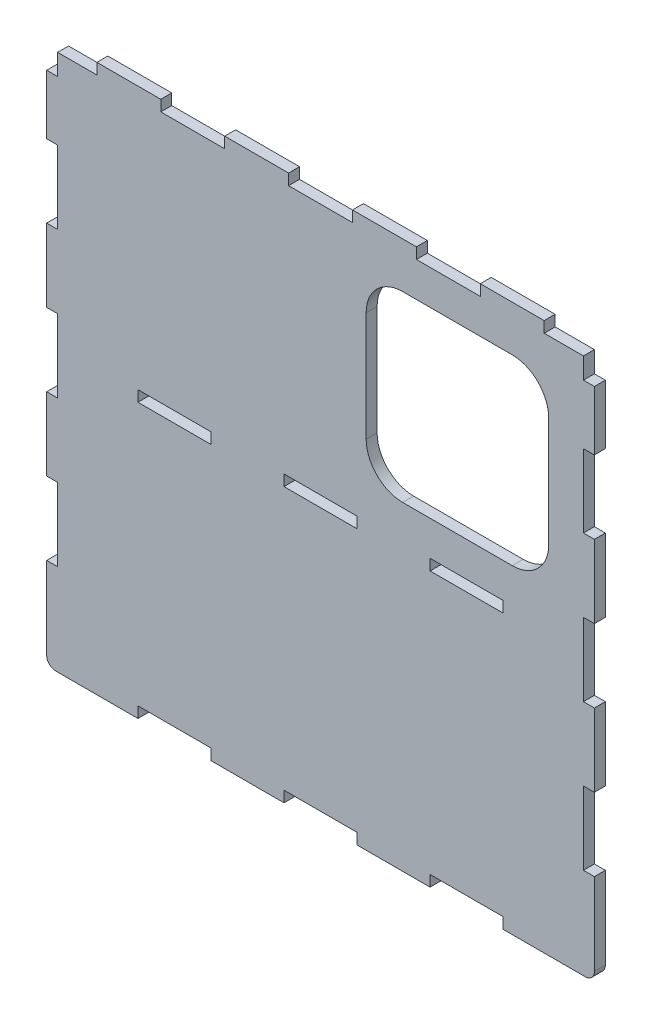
ISO-10303-21;
HEADER;
FILE_DESCRIPTION(('STEP AP214'),'2;1');
FILE_NAME('part.step','',(''),(''),'','','');
FILE_SCHEMA(('AUTOMOTIVE_DESIGN { 1 0 10303 214 1 1 1 1 }'));
ENDSEC;
DATA;
#1=APPLICATION_CONTEXT('core data for automotive mechanical design processes');
#2=APPLICATION_PROTOCOL_DEFINITION('international standard','automotive_design',2000,#1);
#3=PRODUCT_CONTEXT('',#1,'mechanical');
#4=PRODUCT('Part','Part','',(#3));
#5=PRODUCT_RELATED_PRODUCT_CATEGORY('part','',(#4));
#6=PRODUCT_DEFINITION_FORMATION('','',#4);
#7=PRODUCT_DEFINITION_CONTEXT('part definition',#1,'design');
#8=PRODUCT_DEFINITION('design','',#6,#7);
#9=PRODUCT_DEFINITION_SHAPE('','',#8);
#10=(LENGTH_UNIT() NAMED_UNIT(*) SI_UNIT(.MILLI.,.METRE.));
#11=(NAMED_UNIT(*) PLANE_ANGLE_UNIT() SI_UNIT($,.RADIAN.));
#12=(NAMED_UNIT(*) SI_UNIT($,.STERADIAN.) SOLID_ANGLE_UNIT());
#13=UNCERTAINTY_MEASURE_WITH_UNIT(LENGTH_MEASURE(1.E-05),#10,'distance_accuracy_value','');
#14=(GEOMETRIC_REPRESENTATION_CONTEXT(3) GLOBAL_UNCERTAINTY_ASSIGNED_CONTEXT((#13)) GLOBAL_UNIT_ASSIGNED_CONTEXT((#10,
#11,#12)) REPRESENTATION_CONTEXT('',''));
#15=CARTESIAN_POINT('',(0.,0.,0.));
#16=DIRECTION('',(0.,0.,1.));
#17=DIRECTION('',(1.,0.,0.));
#18=AXIS2_PLACEMENT_3D('',#15,#16,#17);
#19=CARTESIAN_POINT('',(300.,290.,12.));
#20=DIRECTION('',(-1.,0.,0.));
#21=DIRECTION('',(0.,-1.,0.));
#22=AXIS2_PLACEMENT_3D('',#19,#20,#21);
#23=PLANE('',#22);
#24=DIRECTION('',(0.,0.,1.));
#25=VECTOR('',#24,1.);
#26=CARTESIAN_POINT('',(300.,265.,0.));
#27=LINE('',#26,#25);
#28=CARTESIAN_POINT('',(300.,265.,0.));
#29=VERTEX_POINT('',#28);
#30=CARTESIAN_POINT('',(300.,265.,12.));
#31=VERTEX_POINT('',#30);
#32=EDGE_CURVE('E762',#29,#31,#27,.T.);
#33=ORIENTED_EDGE('',*,*,#32,.T.);
#34=DIRECTION('',(0.,1.,0.));
#35=VECTOR('',#34,1.);
#36=CARTESIAN_POINT('',(300.,290.,12.));
#37=LINE('',#36,#35);
#38=CARTESIAN_POINT('',(300.,200.,12.));
#39=VERTEX_POINT('',#38);
#40=EDGE_CURVE('E813',#39,#31,#37,.T.);
#41=ORIENTED_EDGE('',*,*,#40,.F.);
#42=DIRECTION('',(0.,0.,-1.));
#43=VECTOR('',#42,1.);
#44=CARTESIAN_POINT('',(300.,200.,12.));
#45=LINE('',#44,#43);
#46=CARTESIAN_POINT('',(300.,200.,0.));
#47=VERTEX_POINT('',#46);
#48=EDGE_CURVE('E1123',#39,#47,#45,.T.);
#49=ORIENTED_EDGE('',*,*,#48,.T.);
#50=DIRECTION('',(0.,1.,0.));
#51=VECTOR('',#50,1.);
#52=CARTESIAN_POINT('',(300.,290.,0.));
#53=LINE('',#52,#51);
#54=EDGE_CURVE('E924',#47,#29,#53,.T.);
#55=ORIENTED_EDGE('',*,*,#54,.T.);
#56=EDGE_LOOP('',(#33,#41,#49,#55));
#57=FACE_BOUND('',#56,.T.);
#58=ADVANCED_FACE('F45',(#57),#23,.F.);
#59=CARTESIAN_POINT('',(-175.,300.,12.));
#60=DIRECTION('',(0.,-1.,0.));
#61=DIRECTION('',(1.,0.,0.));
#62=AXIS2_PLACEMENT_3D('',#59,#60,#61);
#63=PLANE('',#62);
#64=DIRECTION('',(0.,0.,1.));
#65=VECTOR('',#64,1.);
#66=CARTESIAN_POINT('',(-245.,300.,0.));
#67=LINE('',#66,#65);
#68=CARTESIAN_POINT('',(-245.,300.,0.));
#69=VERTEX_POINT('',#68);
#70=CARTESIAN_POINT('',(-245.,300.,12.));
#71=VERTEX_POINT('',#70);
#72=EDGE_CURVE('E739',#69,#71,#67,.T.);
#73=ORIENTED_EDGE('',*,*,#72,.T.);
#74=DIRECTION('',(-1.,0.,0.));
#75=VECTOR('',#74,1.);
#76=CARTESIAN_POINT('',(-175.,300.,12.));
#77=LINE('',#76,#75);
#78=CARTESIAN_POINT('',(-175.,300.,12.));
#79=VERTEX_POINT('',#78);
#80=EDGE_CURVE('E840',#79,#71,#77,.T.);
#81=ORIENTED_EDGE('',*,*,#80,.F.);
#82=DIRECTION('',(0.,0.,-1.));
#83=VECTOR('',#82,1.);
#84=CARTESIAN_POINT('',(-175.,300.,12.));
#85=LINE('',#84,#83);
#86=CARTESIAN_POINT('',(-175.,300.,0.));
#87=VERTEX_POINT('',#86);
#88=EDGE_CURVE('E1087',#79,#87,#85,.T.);
#89=ORIENTED_EDGE('',*,*,#88,.T.);
#90=DIRECTION('',(-1.,0.,0.));
#91=VECTOR('',#90,1.);
#92=CARTESIAN_POINT('',(-175.,300.,0.));
#93=LINE('',#92,#91);
#94=EDGE_CURVE('E951',#87,#69,#93,.T.);
#95=ORIENTED_EDGE('',*,*,#94,.T.);
#96=EDGE_LOOP('',(#73,#81,#89,#95));
#97=FACE_BOUND('',#96,.T.);
#98=ADVANCED_FACE('F1337',(#97),#63,.F.);
#99=CARTESIAN_POINT('',(290.,-290.,12.));
#100=DIRECTION('',(0.,0.,1.));
#101=DIRECTION('',(1.,0.,0.));
#102=AXIS2_PLACEMENT_3D('',#99,#100,#101);
#103=PLANE('',#102);
#104=DIRECTION('',(0.,-1.,0.));
#105=VECTOR('',#104,1.);
#106=CARTESIAN_POINT('',(-200.,12.,12.));
#107=LINE('',#106,#105);
#108=CARTESIAN_POINT('',(-200.,12.,12.));
#109=VERTEX_POINT('',#108);
#110=CARTESIAN_POINT('',(-200.,0.,12.));
#111=VERTEX_POINT('',#110);
#112=EDGE_CURVE('E60',#109,#111,#107,.T.);
#113=ORIENTED_EDGE('',*,*,#112,.F.);
#114=DIRECTION('',(-1.,0.,0.));
#115=VECTOR('',#114,1.);
#116=CARTESIAN_POINT('',(-200.,12.,12.));
#117=LINE('',#116,#115);
#118=CARTESIAN_POINT('',(-120.,12.,12.));
#119=VERTEX_POINT('',#118);
#120=EDGE_CURVE('E575',#119,#109,#117,.T.);
#121=ORIENTED_EDGE('',*,*,#120,.F.);
#122=DIRECTION('',(0.,1.,0.));
#123=VECTOR('',#122,1.);
#124=CARTESIAN_POINT('',(-120.,12.,12.));
#125=LINE('',#124,#123);
#126=CARTESIAN_POINT('',(-120.,0.,12.));
#127=VERTEX_POINT('',#126);
#128=EDGE_CURVE('E578',#127,#119,#125,.T.);
#129=ORIENTED_EDGE('',*,*,#128,.F.);
#130=DIRECTION('',(1.,0.,0.));
#131=VECTOR('',#130,1.);
#132=CARTESIAN_POINT('',(-200.,0.,12.));
#133=LINE('',#132,#131);
#134=EDGE_CURVE('E584',#111,#127,#133,.T.);
#135=ORIENTED_EDGE('',*,*,#134,.F.);
#136=EDGE_LOOP('',(#113,#121,#129,#135));
#137=FACE_BOUND('',#136,.T.);
#138=DIRECTION('',(0.,-1.,0.));
#139=VECTOR('',#138,1.);
#140=CARTESIAN_POINT('',(-40.0000000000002,12.,12.));
#141=LINE('',#140,#139);
#142=CARTESIAN_POINT('',(-40.0000000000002,12.,12.));
#143=VERTEX_POINT('',#142);
#144=CARTESIAN_POINT('',(-40.0000000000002,0.,12.));
#145=VERTEX_POINT('',#144);
#146=EDGE_CURVE('E68',#143,#145,#141,.T.);
#147=ORIENTED_EDGE('',*,*,#146,.F.);
#148=DIRECTION('',(-1.,0.,0.));
#149=VECTOR('',#148,1.);
#150=CARTESIAN_POINT('',(-40.0000000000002,12.,12.));
#151=LINE('',#150,#149);
#152=CARTESIAN_POINT('',(39.9999999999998,12.,12.));
#153=VERTEX_POINT('',#152);
#154=EDGE_CURVE('E604',#153,#143,#151,.T.);
#155=ORIENTED_EDGE('',*,*,#154,.F.);
#156=DIRECTION('',(0.,1.,0.));
#157=VECTOR('',#156,1.);
#158=CARTESIAN_POINT('',(39.9999999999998,12.,12.));
#159=LINE('',#158,#157);
#160=CARTESIAN_POINT('',(39.9999999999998,0.,12.));
#161=VERTEX_POINT('',#160);
#162=EDGE_CURVE('E607',#161,#153,#159,.T.);
#163=ORIENTED_EDGE('',*,*,#162,.F.);
#164=DIRECTION('',(1.,0.,0.));
#165=VECTOR('',#164,1.);
#166=CARTESIAN_POINT('',(-40.0000000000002,0.,12.));
#167=LINE('',#166,#165);
#168=EDGE_CURVE('E611',#145,#161,#167,.T.);
#169=ORIENTED_EDGE('',*,*,#168,.F.);
#170=EDGE_LOOP('',(#147,#155,#163,#169));
#171=FACE_BOUND('',#170,.T.);
#172=DIRECTION('',(0.,-1.,0.));
#173=VECTOR('',#172,1.);
#174=CARTESIAN_POINT('',(120.,12.,12.));
#175=LINE('',#174,#173);
#176=CARTESIAN_POINT('',(120.,12.,12.));
#177=VERTEX_POINT('',#176);
#178=CARTESIAN_POINT('',(120.,0.,12.));
#179=VERTEX_POINT('',#178);
#180=EDGE_CURVE('E603',#177,#179,#175,.T.);
#181=ORIENTED_EDGE('',*,*,#180,.F.);
#182=DIRECTION('',(-1.,0.,0.));
#183=VECTOR('',#182,1.);
#184=CARTESIAN_POINT('',(120.,12.,12.));
#185=LINE('',#184,#183);
#186=CARTESIAN_POINT('',(200.,12.,12.));
#187=VERTEX_POINT('',#186);
#188=EDGE_CURVE('E635',#187,#177,#185,.T.);
#189=ORIENTED_EDGE('',*,*,#188,.F.);
#190=DIRECTION('',(0.,1.,0.));
#191=VECTOR('',#190,1.);
#192=CARTESIAN_POINT('',(200.,12.,12.));
#193=LINE('',#192,#191);
#194=CARTESIAN_POINT('',(200.,0.,12.));
#195=VERTEX_POINT('',#194);
#196=EDGE_CURVE('E638',#195,#187,#193,.T.);
#197=ORIENTED_EDGE('',*,*,#196,.F.);
#198=DIRECTION('',(1.,0.,0.));
#199=VECTOR('',#198,1.);
#200=CARTESIAN_POINT('',(120.,0.,12.));
#201=LINE('',#200,#199);
#202=EDGE_CURVE('E642',#179,#195,#201,.T.);
#203=ORIENTED_EDGE('',*,*,#202,.F.);
#204=EDGE_LOOP('',(#181,#189,#197,#203));
#205=FACE_BOUND('',#204,.T.);
#206=CARTESIAN_POINT('',(90.0000000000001,210.,12.));
#207=DIRECTION('',(0.,0.,1.));
#208=DIRECTION('',(1.,0.,0.));
#209=AXIS2_PLACEMENT_3D('',#206,#207,#208);
#210=CIRCLE('',#209,40.);
#211=CARTESIAN_POINT('',(90.0000000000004,250.,12.));
#212=VERTEX_POINT('',#211);
#213=CARTESIAN_POINT('',(50.,210.,12.));
#214=VERTEX_POINT('',#213);
#215=EDGE_CURVE('E697',#212,#214,#210,.T.);
#216=ORIENTED_EDGE('',*,*,#215,.F.);
#217=DIRECTION('',(1.,0.,0.));
#218=VECTOR('',#217,1.);
#219=CARTESIAN_POINT('',(90.0000000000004,250.,12.));
#220=LINE('',#219,#218);
#221=CARTESIAN_POINT('',(210.,250.,12.));
#222=VERTEX_POINT('',#221);
#223=EDGE_CURVE('E675',#212,#222,#220,.T.);
#224=ORIENTED_EDGE('',*,*,#223,.T.);
#225=CARTESIAN_POINT('',(210.,210.,12.));
#226=DIRECTION('',(0.,0.,-1.));
#227=DIRECTION('',(-1.,0.,0.));
#228=AXIS2_PLACEMENT_3D('',#225,#226,#227);
#229=CIRCLE('',#228,40.);
#230=CARTESIAN_POINT('',(250.,210.,12.));
#231=VERTEX_POINT('',#230);
#232=EDGE_CURVE('E678',#222,#231,#229,.T.);
#233=ORIENTED_EDGE('',*,*,#232,.T.);
#234=DIRECTION('',(0.,-1.,0.));
#235=VECTOR('',#234,1.);
#236=CARTESIAN_POINT('',(250.,210.,12.));
#237=LINE('',#236,#235);
#238=CARTESIAN_POINT('',(250.,90.0000000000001,12.));
#239=VERTEX_POINT('',#238);
#240=EDGE_CURVE('E682',#231,#239,#237,.T.);
#241=ORIENTED_EDGE('',*,*,#240,.T.);
#242=CARTESIAN_POINT('',(210.,90.0000000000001,12.));
#243=DIRECTION('',(0.,0.,1.));
#244=DIRECTION('',(1.,0.,0.));
#245=AXIS2_PLACEMENT_3D('',#242,#243,#244);
#246=CIRCLE('',#245,40.);
#247=CARTESIAN_POINT('',(210.,50.,12.));
#248=VERTEX_POINT('',#247);
#249=EDGE_CURVE('E685',#248,#239,#246,.T.);
#250=ORIENTED_EDGE('',*,*,#249,.F.);
#251=DIRECTION('',(1.,0.,0.));
#252=VECTOR('',#251,1.);
#253=CARTESIAN_POINT('',(90.,50.,12.));
#254=LINE('',#253,#252);
#255=CARTESIAN_POINT('',(90.,50.,12.));
#256=VERTEX_POINT('',#255);
#257=EDGE_CURVE('E688',#256,#248,#254,.T.);
#258=ORIENTED_EDGE('',*,*,#257,.F.);
#259=CARTESIAN_POINT('',(90.0000000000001,90.0000000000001,12.));
#260=DIRECTION('',(0.,0.,1.));
#261=DIRECTION('',(1.,0.,0.));
#262=AXIS2_PLACEMENT_3D('',#259,#260,#261);
#263=CIRCLE('',#262,40.0000000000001);
#264=CARTESIAN_POINT('',(50.,90.0000000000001,12.));
#265=VERTEX_POINT('',#264);
#266=EDGE_CURVE('E691',#265,#256,#263,.T.);
#267=ORIENTED_EDGE('',*,*,#266,.F.);
#268=DIRECTION('',(0.,-1.,0.));
#269=VECTOR('',#268,1.);
#270=CARTESIAN_POINT('',(50.,210.,12.));
#271=LINE('',#270,#269);
#272=EDGE_CURVE('E694',#214,#265,#271,.T.);
#273=ORIENTED_EDGE('',*,*,#272,.F.);
#274=EDGE_LOOP('',(#216,#224,#233,#241,#250,#258,#267,#273));
#275=FACE_BOUND('',#274,.T.);
#276=ORIENTED_EDGE('',*,*,#80,.T.);
#277=DIRECTION('',(0.,-1.,0.));
#278=VECTOR('',#277,1.);
#279=CARTESIAN_POINT('',(-245.,300.,12.));
#280=LINE('',#279,#278);
#281=CARTESIAN_POINT('',(-245.,288.,12.));
#282=VERTEX_POINT('',#281);
#283=EDGE_CURVE('E726',#71,#282,#280,.T.);
#284=ORIENTED_EDGE('',*,*,#283,.T.);
#285=DIRECTION('',(-1.,0.,0.));
#286=VECTOR('',#285,1.);
#287=CARTESIAN_POINT('',(-245.,288.,12.));
#288=LINE('',#287,#286);
#289=CARTESIAN_POINT('',(-288.,288.,12.));
#290=VERTEX_POINT('',#289);
#291=EDGE_CURVE('E743',#282,#290,#288,.T.);
#292=ORIENTED_EDGE('',*,*,#291,.T.);
#293=DIRECTION('',(0.,1.,0.));
#294=VECTOR('',#293,1.);
#295=CARTESIAN_POINT('',(-288.,265.,12.));
#296=LINE('',#295,#294);
#297=CARTESIAN_POINT('',(-288.,265.,12.));
#298=VERTEX_POINT('',#297);
#299=EDGE_CURVE('E727',#298,#290,#296,.T.);
#300=ORIENTED_EDGE('',*,*,#299,.F.);
#301=DIRECTION('',(1.,0.,0.));
#302=VECTOR('',#301,1.);
#303=CARTESIAN_POINT('',(-300.,265.,12.));
#304=LINE('',#303,#302);
#305=CARTESIAN_POINT('',(-300.,265.,12.));
#306=VERTEX_POINT('',#305);
#307=EDGE_CURVE('E674',#306,#298,#304,.T.);
#308=ORIENTED_EDGE('',*,*,#307,.F.);
#309=DIRECTION('',(0.,-1.,0.));
#310=VECTOR('',#309,1.);
#311=CARTESIAN_POINT('',(-300.,290.,12.));
#312=LINE('',#311,#310);
#313=CARTESIAN_POINT('',(-300.,200.,12.));
#314=VERTEX_POINT('',#313);
#315=EDGE_CURVE('E843',#306,#314,#312,.T.);
#316=ORIENTED_EDGE('',*,*,#315,.T.);
#317=DIRECTION('',(1.,0.,0.));
#318=VECTOR('',#317,1.);
#319=CARTESIAN_POINT('',(-300.,200.,12.));
#320=LINE('',#319,#318);
#321=CARTESIAN_POINT('',(-288.,200.,12.));
#322=VERTEX_POINT('',#321);
#323=EDGE_CURVE('E845',#314,#322,#320,.T.);
#324=ORIENTED_EDGE('',*,*,#323,.T.);
#325=DIRECTION('',(0.,-1.,0.));
#326=VECTOR('',#325,1.);
#327=CARTESIAN_POINT('',(-288.,120.,12.));
#328=LINE('',#327,#326);
#329=CARTESIAN_POINT('',(-288.,120.,12.));
#330=VERTEX_POINT('',#329);
#331=EDGE_CURVE('E847',#322,#330,#328,.T.);
#332=ORIENTED_EDGE('',*,*,#331,.T.);
#333=DIRECTION('',(-1.,0.,0.));
#334=VECTOR('',#333,1.);
#335=CARTESIAN_POINT('',(-300.,120.,12.));
#336=LINE('',#335,#334);
#337=CARTESIAN_POINT('',(-300.,120.,12.));
#338=VERTEX_POINT('',#337);
#339=EDGE_CURVE('E849',#330,#338,#336,.T.);
#340=ORIENTED_EDGE('',*,*,#339,.T.);
#341=DIRECTION('',(0.,-1.,0.));
#342=VECTOR('',#341,1.);
#343=CARTESIAN_POINT('',(-300.,120.,12.));
#344=LINE('',#343,#342);
#345=CARTESIAN_POINT('',(-300.,40.,12.));
#346=VERTEX_POINT('',#345);
#347=EDGE_CURVE('E851',#338,#346,#344,.T.);
#348=ORIENTED_EDGE('',*,*,#347,.T.);
#349=DIRECTION('',(1.,0.,0.));
#350=VECTOR('',#349,1.);
#351=CARTESIAN_POINT('',(-300.,40.,12.));
#352=LINE('',#351,#350);
#353=CARTESIAN_POINT('',(-288.,40.,12.));
#354=VERTEX_POINT('',#353);
#355=EDGE_CURVE('E853',#346,#354,#352,.T.);
#356=ORIENTED_EDGE('',*,*,#355,.T.);
#357=DIRECTION('',(0.,-1.,0.));
#358=VECTOR('',#357,1.);
#359=CARTESIAN_POINT('',(-288.,-39.9999999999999,12.));
#360=LINE('',#359,#358);
#361=CARTESIAN_POINT('',(-288.,-39.9999999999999,12.));
#362=VERTEX_POINT('',#361);
#363=EDGE_CURVE('E855',#354,#362,#360,.T.);
#364=ORIENTED_EDGE('',*,*,#363,.T.);
#365=DIRECTION('',(-1.,0.,0.));
#366=VECTOR('',#365,1.);
#367=CARTESIAN_POINT('',(-300.,-39.9999999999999,12.));
#368=LINE('',#367,#366);
#369=CARTESIAN_POINT('',(-300.,-39.9999999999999,12.));
#370=VERTEX_POINT('',#369);
#371=EDGE_CURVE('E857',#362,#370,#368,.T.);
#372=ORIENTED_EDGE('',*,*,#371,.T.);
#373=DIRECTION('',(0.,-1.,0.));
#374=VECTOR('',#373,1.);
#375=CARTESIAN_POINT('',(-300.,-39.9999999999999,12.));
#376=LINE('',#375,#374);
#377=CARTESIAN_POINT('',(-300.,-120.,12.));
#378=VERTEX_POINT('',#377);
#379=EDGE_CURVE('E859',#370,#378,#376,.T.);
#380=ORIENTED_EDGE('',*,*,#379,.T.);
#381=DIRECTION('',(1.,0.,0.));
#382=VECTOR('',#381,1.);
#383=CARTESIAN_POINT('',(-300.,-120.,12.));
#384=LINE('',#383,#382);
#385=CARTESIAN_POINT('',(-288.,-120.,12.));
#386=VERTEX_POINT('',#385);
#387=EDGE_CURVE('E861',#378,#386,#384,.T.);
#388=ORIENTED_EDGE('',*,*,#387,.T.);
#389=DIRECTION('',(0.,-1.,0.));
#390=VECTOR('',#389,1.);
#391=CARTESIAN_POINT('',(-288.,-200.,12.));
#392=LINE('',#391,#390);
#393=CARTESIAN_POINT('',(-288.,-200.,12.));
#394=VERTEX_POINT('',#393);
#395=EDGE_CURVE('E863',#386,#394,#392,.T.);
#396=ORIENTED_EDGE('',*,*,#395,.T.);
#397=DIRECTION('',(-1.,0.,0.));
#398=VECTOR('',#397,1.);
#399=CARTESIAN_POINT('',(-300.,-200.,12.));
#400=LINE('',#399,#398);
#401=CARTESIAN_POINT('',(-300.,-200.,12.));
#402=VERTEX_POINT('',#401);
#403=EDGE_CURVE('E865',#394,#402,#400,.T.);
#404=ORIENTED_EDGE('',*,*,#403,.T.);
#405=DIRECTION('',(0.,-1.,0.));
#406=VECTOR('',#405,1.);
#407=CARTESIAN_POINT('',(-300.,-200.,12.));
#408=LINE('',#407,#406);
#409=CARTESIAN_POINT('',(-300.,-290.,12.));
#410=VERTEX_POINT('',#409);
#411=EDGE_CURVE('E867',#402,#410,#408,.T.);
#412=ORIENTED_EDGE('',*,*,#411,.T.);
#413=CARTESIAN_POINT('',(-290.,-290.,12.));
#414=DIRECTION('',(0.,0.,1.));
#415=DIRECTION('',(1.,0.,0.));
#416=AXIS2_PLACEMENT_3D('',#413,#414,#415);
#417=CIRCLE('',#416,10.);
#418=CARTESIAN_POINT('',(-290.,-300.,12.));
#419=VERTEX_POINT('',#418);
#420=EDGE_CURVE('E869',#410,#419,#417,.T.);
#421=ORIENTED_EDGE('',*,*,#420,.T.);
#422=DIRECTION('',(1.,0.,0.));
#423=VECTOR('',#422,1.);
#424=CARTESIAN_POINT('',(-290.,-300.,12.));
#425=LINE('',#424,#423);
#426=CARTESIAN_POINT('',(-200.,-300.,12.));
#427=VERTEX_POINT('',#426);
#428=EDGE_CURVE('E871',#419,#427,#425,.T.);
#429=ORIENTED_EDGE('',*,*,#428,.T.);
#430=DIRECTION('',(0.,1.,0.));
#431=VECTOR('',#430,1.);
#432=CARTESIAN_POINT('',(-200.,-300.,12.));
#433=LINE('',#432,#431);
#434=CARTESIAN_POINT('',(-200.,-288.,12.));
#435=VERTEX_POINT('',#434);
#436=EDGE_CURVE('E873',#427,#435,#433,.T.);
#437=ORIENTED_EDGE('',*,*,#436,.T.);
#438=DIRECTION('',(1.,0.,0.));
#439=VECTOR('',#438,1.);
#440=CARTESIAN_POINT('',(-200.,-288.,12.));
#441=LINE('',#440,#439);
#442=CARTESIAN_POINT('',(-120.,-288.,12.));
#443=VERTEX_POINT('',#442);
#444=EDGE_CURVE('E875',#435,#443,#441,.T.);
#445=ORIENTED_EDGE('',*,*,#444,.T.);
#446=DIRECTION('',(0.,-1.,0.));
#447=VECTOR('',#446,1.);
#448=CARTESIAN_POINT('',(-120.,-300.,12.));
#449=LINE('',#448,#447);
#450=CARTESIAN_POINT('',(-120.,-300.,12.));
#451=VERTEX_POINT('',#450);
#452=EDGE_CURVE('E877',#443,#451,#449,.T.);
#453=ORIENTED_EDGE('',*,*,#452,.T.);
#454=DIRECTION('',(1.,0.,0.));
#455=VECTOR('',#454,1.);
#456=CARTESIAN_POINT('',(-120.,-300.,12.));
#457=LINE('',#456,#455);
#458=CARTESIAN_POINT('',(-39.9999999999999,-300.,12.));
#459=VERTEX_POINT('',#458);
#460=EDGE_CURVE('E879',#451,#459,#457,.T.);
#461=ORIENTED_EDGE('',*,*,#460,.T.);
#462=DIRECTION('',(0.,1.,0.));
#463=VECTOR('',#462,1.);
#464=CARTESIAN_POINT('',(-39.9999999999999,-300.,12.));
#465=LINE('',#464,#463);
#466=CARTESIAN_POINT('',(-39.9999999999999,-288.,12.));
#467=VERTEX_POINT('',#466);
#468=EDGE_CURVE('E881',#459,#467,#465,.T.);
#469=ORIENTED_EDGE('',*,*,#468,.T.);
#470=DIRECTION('',(1.,0.,0.));
#471=VECTOR('',#470,1.);
#472=CARTESIAN_POINT('',(-39.9999999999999,-288.,12.));
#473=LINE('',#472,#471);
#474=CARTESIAN_POINT('',(40.0000000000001,-288.,12.));
#475=VERTEX_POINT('',#474);
#476=EDGE_CURVE('E883',#467,#475,#473,.T.);
#477=ORIENTED_EDGE('',*,*,#476,.T.);
#478=DIRECTION('',(0.,-1.,0.));
#479=VECTOR('',#478,1.);
#480=CARTESIAN_POINT('',(40.0000000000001,-300.,12.));
#481=LINE('',#480,#479);
#482=CARTESIAN_POINT('',(40.0000000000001,-300.,12.));
#483=VERTEX_POINT('',#482);
#484=EDGE_CURVE('E885',#475,#483,#481,.T.);
#485=ORIENTED_EDGE('',*,*,#484,.T.);
#486=DIRECTION('',(1.,0.,0.));
#487=VECTOR('',#486,1.);
#488=CARTESIAN_POINT('',(40.0000000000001,-300.,12.));
#489=LINE('',#488,#487);
#490=CARTESIAN_POINT('',(120.,-300.,12.));
#491=VERTEX_POINT('',#490);
#492=EDGE_CURVE('E887',#483,#491,#489,.T.);
#493=ORIENTED_EDGE('',*,*,#492,.T.);
#494=DIRECTION('',(0.,1.,0.));
#495=VECTOR('',#494,1.);
#496=CARTESIAN_POINT('',(120.,-300.,12.));
#497=LINE('',#496,#495);
#498=CARTESIAN_POINT('',(120.,-288.,12.));
#499=VERTEX_POINT('',#498);
#500=EDGE_CURVE('E889',#491,#499,#497,.T.);
#501=ORIENTED_EDGE('',*,*,#500,.T.);
#502=DIRECTION('',(1.,0.,0.));
#503=VECTOR('',#502,1.);
#504=CARTESIAN_POINT('',(120.,-288.,12.));
#505=LINE('',#504,#503);
#506=CARTESIAN_POINT('',(200.,-288.,12.));
#507=VERTEX_POINT('',#506);
#508=EDGE_CURVE('E891',#499,#507,#505,.T.);
#509=ORIENTED_EDGE('',*,*,#508,.T.);
#510=DIRECTION('',(0.,-1.,0.));
#511=VECTOR('',#510,1.);
#512=CARTESIAN_POINT('',(200.,-300.,12.));
#513=LINE('',#512,#511);
#514=CARTESIAN_POINT('',(200.,-300.,12.));
#515=VERTEX_POINT('',#514);
#516=EDGE_CURVE('E893',#507,#515,#513,.T.);
#517=ORIENTED_EDGE('',*,*,#516,.T.);
#518=DIRECTION('',(1.,0.,0.));
#519=VECTOR('',#518,1.);
#520=CARTESIAN_POINT('',(200.,-300.,12.));
#521=LINE('',#520,#519);
#522=CARTESIAN_POINT('',(290.,-300.,12.));
#523=VERTEX_POINT('',#522);
#524=EDGE_CURVE('E895',#515,#523,#521,.T.);
#525=ORIENTED_EDGE('',*,*,#524,.T.);
#526=CARTESIAN_POINT('',(290.,-290.,12.));
#527=DIRECTION('',(0.,0.,1.));
#528=DIRECTION('',(1.,0.,0.));
#529=AXIS2_PLACEMENT_3D('',#526,#527,#528);
#530=CIRCLE('',#529,10.);
#531=CARTESIAN_POINT('',(300.,-290.,12.));
#532=VERTEX_POINT('',#531);
#533=EDGE_CURVE('E785',#523,#532,#530,.T.);
#534=ORIENTED_EDGE('',*,*,#533,.T.);
#535=DIRECTION('',(0.,1.,0.));
#536=VECTOR('',#535,1.);
#537=CARTESIAN_POINT('',(300.,-200.,12.));
#538=LINE('',#537,#536);
#539=CARTESIAN_POINT('',(300.,-200.,12.));
#540=VERTEX_POINT('',#539);
#541=EDGE_CURVE('E788',#532,#540,#538,.T.);
#542=ORIENTED_EDGE('',*,*,#541,.T.);
#543=DIRECTION('',(-1.,0.,0.));
#544=VECTOR('',#543,1.);
#545=CARTESIAN_POINT('',(300.,-200.,12.));
#546=LINE('',#545,#544);
#547=CARTESIAN_POINT('',(288.,-200.,12.));
#548=VERTEX_POINT('',#547);
#549=EDGE_CURVE('E791',#540,#548,#546,.T.);
#550=ORIENTED_EDGE('',*,*,#549,.T.);
#551=DIRECTION('',(0.,1.,0.));
#552=VECTOR('',#551,1.);
#553=CARTESIAN_POINT('',(288.,-200.,12.));
#554=LINE('',#553,#552);
#555=CARTESIAN_POINT('',(288.,-120.,12.));
#556=VERTEX_POINT('',#555);
#557=EDGE_CURVE('E793',#548,#556,#554,.T.);
#558=ORIENTED_EDGE('',*,*,#557,.T.);
#559=DIRECTION('',(1.,0.,0.));
#560=VECTOR('',#559,1.);
#561=CARTESIAN_POINT('',(300.,-120.,12.));
#562=LINE('',#561,#560);
#563=CARTESIAN_POINT('',(300.,-120.,12.));
#564=VERTEX_POINT('',#563);
#565=EDGE_CURVE('E795',#556,#564,#562,.T.);
#566=ORIENTED_EDGE('',*,*,#565,.T.);
#567=DIRECTION('',(0.,1.,0.));
#568=VECTOR('',#567,1.);
#569=CARTESIAN_POINT('',(300.,-39.9999999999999,12.));
#570=LINE('',#569,#568);
#571=CARTESIAN_POINT('',(300.,-39.9999999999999,12.));
#572=VERTEX_POINT('',#571);
#573=EDGE_CURVE('E797',#564,#572,#570,.T.);
#574=ORIENTED_EDGE('',*,*,#573,.T.);
#575=DIRECTION('',(-1.,0.,0.));
#576=VECTOR('',#575,1.);
#577=CARTESIAN_POINT('',(300.,-39.9999999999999,12.));
#578=LINE('',#577,#576);
#579=CARTESIAN_POINT('',(288.,-39.9999999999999,12.));
#580=VERTEX_POINT('',#579);
#581=EDGE_CURVE('E799',#572,#580,#578,.T.);
#582=ORIENTED_EDGE('',*,*,#581,.T.);
#583=DIRECTION('',(0.,1.,0.));
#584=VECTOR('',#583,1.);
#585=CARTESIAN_POINT('',(288.,-39.9999999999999,12.));
#586=LINE('',#585,#584);
#587=CARTESIAN_POINT('',(288.,40.,12.));
#588=VERTEX_POINT('',#587);
#589=EDGE_CURVE('E801',#580,#588,#586,.T.);
#590=ORIENTED_EDGE('',*,*,#589,.T.);
#591=DIRECTION('',(1.,0.,0.));
#592=VECTOR('',#591,1.);
#593=CARTESIAN_POINT('',(300.,40.,12.));
#594=LINE('',#593,#592);
#595=CARTESIAN_POINT('',(300.,40.,12.));
#596=VERTEX_POINT('',#595);
#597=EDGE_CURVE('E803',#588,#596,#594,.T.);
#598=ORIENTED_EDGE('',*,*,#597,.T.);
#599=DIRECTION('',(0.,1.,0.));
#600=VECTOR('',#599,1.);
#601=CARTESIAN_POINT('',(300.,120.,12.));
#602=LINE('',#601,#600);
#603=CARTESIAN_POINT('',(300.,120.,12.));
#604=VERTEX_POINT('',#603);
#605=EDGE_CURVE('E805',#596,#604,#602,.T.);
#606=ORIENTED_EDGE('',*,*,#605,.T.);
#607=DIRECTION('',(-1.,0.,0.));
#608=VECTOR('',#607,1.);
#609=CARTESIAN_POINT('',(300.,120.,12.));
#610=LINE('',#609,#608);
#611=CARTESIAN_POINT('',(288.,120.,12.));
#612=VERTEX_POINT('',#611);
#613=EDGE_CURVE('E807',#604,#612,#610,.T.);
#614=ORIENTED_EDGE('',*,*,#613,.T.);
#615=DIRECTION('',(0.,1.,0.));
#616=VECTOR('',#615,1.);
#617=CARTESIAN_POINT('',(288.,120.,12.));
#618=LINE('',#617,#616);
#619=CARTESIAN_POINT('',(288.,200.,12.));
#620=VERTEX_POINT('',#619);
#621=EDGE_CURVE('E809',#612,#620,#618,.T.);
#622=ORIENTED_EDGE('',*,*,#621,.T.);
#623=DIRECTION('',(1.,0.,0.));
#624=VECTOR('',#623,1.);
#625=CARTESIAN_POINT('',(300.,200.,12.));
#626=LINE('',#625,#624);
#627=EDGE_CURVE('E811',#620,#39,#626,.T.);
#628=ORIENTED_EDGE('',*,*,#627,.T.);
#629=ORIENTED_EDGE('',*,*,#40,.T.);
#630=DIRECTION('',(-1.,0.,0.));
#631=VECTOR('',#630,1.);
#632=CARTESIAN_POINT('',(0.,265.,12.));
#633=LINE('',#632,#631);
#634=CARTESIAN_POINT('',(288.,265.,12.));
#635=VERTEX_POINT('',#634);
#636=EDGE_CURVE('E699',#31,#635,#633,.T.);
#637=ORIENTED_EDGE('',*,*,#636,.T.);
#638=DIRECTION('',(0.,1.,0.));
#639=VECTOR('',#638,1.);
#640=CARTESIAN_POINT('',(288.,0.,12.));
#641=LINE('',#640,#639);
#642=CARTESIAN_POINT('',(288.,288.,12.));
#643=VERTEX_POINT('',#642);
#644=EDGE_CURVE('E754',#635,#643,#641,.T.);
#645=ORIENTED_EDGE('',*,*,#644,.T.);
#646=DIRECTION('',(1.,0.,0.));
#647=VECTOR('',#646,1.);
#648=CARTESIAN_POINT('',(0.,288.,12.));
#649=LINE('',#648,#647);
#650=CARTESIAN_POINT('',(245.,288.,12.));
#651=VERTEX_POINT('',#650);
#652=EDGE_CURVE('E766',#651,#643,#649,.T.);
#653=ORIENTED_EDGE('',*,*,#652,.F.);
#654=DIRECTION('',(0.,-1.,0.));
#655=VECTOR('',#654,1.);
#656=CARTESIAN_POINT('',(245.000000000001,5.66676335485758E-13,12.));
#657=LINE('',#656,#655);
#658=CARTESIAN_POINT('',(245.,300.,12.));
#659=VERTEX_POINT('',#658);
#660=EDGE_CURVE('E765',#659,#651,#657,.T.);
#661=ORIENTED_EDGE('',*,*,#660,.F.);
#662=DIRECTION('',(-1.,0.,0.));
#663=VECTOR('',#662,1.);
#664=CARTESIAN_POINT('',(175.,300.,12.));
#665=LINE('',#664,#663);
#666=CARTESIAN_POINT('',(175.,300.,12.));
#667=VERTEX_POINT('',#666);
#668=EDGE_CURVE('E816',#659,#667,#665,.T.);
#669=ORIENTED_EDGE('',*,*,#668,.T.);
#670=DIRECTION('',(0.,-1.,0.));
#671=VECTOR('',#670,1.);
#672=CARTESIAN_POINT('',(175.,288.,12.));
#673=LINE('',#672,#671);
#674=CARTESIAN_POINT('',(175.,288.,12.));
#675=VERTEX_POINT('',#674);
#676=EDGE_CURVE('E818',#667,#675,#673,.T.);
#677=ORIENTED_EDGE('',*,*,#676,.T.);
#678=DIRECTION('',(-1.,0.,0.));
#679=VECTOR('',#678,1.);
#680=CARTESIAN_POINT('',(105.,288.,12.));
#681=LINE('',#680,#679);
#682=CARTESIAN_POINT('',(105.,288.,12.));
#683=VERTEX_POINT('',#682);
#684=EDGE_CURVE('E820',#675,#683,#681,.T.);
#685=ORIENTED_EDGE('',*,*,#684,.T.);
#686=DIRECTION('',(0.,1.,0.));
#687=VECTOR('',#686,1.);
#688=CARTESIAN_POINT('',(105.,300.,12.));
#689=LINE('',#688,#687);
#690=CARTESIAN_POINT('',(105.,300.,12.));
#691=VERTEX_POINT('',#690);
#692=EDGE_CURVE('E822',#683,#691,#689,.T.);
#693=ORIENTED_EDGE('',*,*,#692,.T.);
#694=DIRECTION('',(-1.,0.,0.));
#695=VECTOR('',#694,1.);
#696=CARTESIAN_POINT('',(34.9999999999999,300.,12.));
#697=LINE('',#696,#695);
#698=CARTESIAN_POINT('',(34.9999999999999,300.,12.));
#699=VERTEX_POINT('',#698);
#700=EDGE_CURVE('E824',#691,#699,#697,.T.);
#701=ORIENTED_EDGE('',*,*,#700,.T.);
#702=DIRECTION('',(0.,-1.,0.));
#703=VECTOR('',#702,1.);
#704=CARTESIAN_POINT('',(34.9999999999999,288.,12.));
#705=LINE('',#704,#703);
#706=CARTESIAN_POINT('',(34.9999999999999,288.,12.));
#707=VERTEX_POINT('',#706);
#708=EDGE_CURVE('E826',#699,#707,#705,.T.);
#709=ORIENTED_EDGE('',*,*,#708,.T.);
#710=DIRECTION('',(-1.,0.,0.));
#711=VECTOR('',#710,1.);
#712=CARTESIAN_POINT('',(-35.0000000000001,288.,12.));
#713=LINE('',#712,#711);
#714=CARTESIAN_POINT('',(-35.0000000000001,288.,12.));
#715=VERTEX_POINT('',#714);
#716=EDGE_CURVE('E828',#707,#715,#713,.T.);
#717=ORIENTED_EDGE('',*,*,#716,.T.);
#718=DIRECTION('',(0.,1.,0.));
#719=VECTOR('',#718,1.);
#720=CARTESIAN_POINT('',(-35.0000000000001,300.,12.));
#721=LINE('',#720,#719);
#722=CARTESIAN_POINT('',(-35.0000000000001,300.,12.));
#723=VERTEX_POINT('',#722);
#724=EDGE_CURVE('E830',#715,#723,#721,.T.);
#725=ORIENTED_EDGE('',*,*,#724,.T.);
#726=DIRECTION('',(-1.,0.,0.));
#727=VECTOR('',#726,1.);
#728=CARTESIAN_POINT('',(-105.,300.,12.));
#729=LINE('',#728,#727);
#730=CARTESIAN_POINT('',(-105.,300.,12.));
#731=VERTEX_POINT('',#730);
#732=EDGE_CURVE('E832',#723,#731,#729,.T.);
#733=ORIENTED_EDGE('',*,*,#732,.T.);
#734=DIRECTION('',(0.,-1.,0.));
#735=VECTOR('',#734,1.);
#736=CARTESIAN_POINT('',(-105.,288.,12.));
#737=LINE('',#736,#735);
#738=CARTESIAN_POINT('',(-105.,288.,12.));
#739=VERTEX_POINT('',#738);
#740=EDGE_CURVE('E834',#731,#739,#737,.T.);
#741=ORIENTED_EDGE('',*,*,#740,.T.);
#742=DIRECTION('',(-1.,0.,0.));
#743=VECTOR('',#742,1.);
#744=CARTESIAN_POINT('',(-175.,288.,12.));
#745=LINE('',#744,#743);
#746=CARTESIAN_POINT('',(-175.,288.,12.));
#747=VERTEX_POINT('',#746);
#748=EDGE_CURVE('E836',#739,#747,#745,.T.);
#749=ORIENTED_EDGE('',*,*,#748,.T.);
#750=DIRECTION('',(0.,1.,0.));
#751=VECTOR('',#750,1.);
#752=CARTESIAN_POINT('',(-175.,288.,12.));
#753=LINE('',#752,#751);
#754=EDGE_CURVE('E838',#747,#79,#753,.T.);
#755=ORIENTED_EDGE('',*,*,#754,.T.);
#756=EDGE_LOOP('',(#276,#284,#292,#300,#308,#316,#324,#332,#340,#348,#356,#364,#372,#380,#388,
#396,#404,#412,#421,#429,#437,#445,#453,#461,#469,#477,#485,#493,#501,#509,#517,#525,#534,#542,
#550,#558,#566,#574,#582,#590,#598,#606,#614,#622,#628,#629,#637,#645,#653,#661,#669,#677,#685,
#693,#701,#709,#717,#725,#733,#741,#749,#755));
#757=FACE_BOUND('',#756,.T.);
#758=ADVANCED_FACE('F1179',(#137,#171,#205,#275,#757),#103,.T.);
#759=CARTESIAN_POINT('',(290.,-290.,0.));
#760=DIRECTION('',(0.,0.,1.));
#761=DIRECTION('',(1.,0.,0.));
#762=AXIS2_PLACEMENT_3D('',#759,#760,#761);
#763=PLANE('',#762);
#764=DIRECTION('',(-1.,0.,0.));
#765=VECTOR('',#764,1.);
#766=CARTESIAN_POINT('',(-200.,12.,0.));
#767=LINE('',#766,#765);
#768=CARTESIAN_POINT('',(-120.,12.,0.));
#769=VERTEX_POINT('',#768);
#770=CARTESIAN_POINT('',(-200.,12.,0.));
#771=VERTEX_POINT('',#770);
#772=EDGE_CURVE('E562',#769,#771,#767,.T.);
#773=ORIENTED_EDGE('',*,*,#772,.T.);
#774=DIRECTION('',(0.,-1.,0.));
#775=VECTOR('',#774,1.);
#776=CARTESIAN_POINT('',(-200.,12.,0.));
#777=LINE('',#776,#775);
#778=CARTESIAN_POINT('',(-200.,0.,0.));
#779=VERTEX_POINT('',#778);
#780=EDGE_CURVE('E556',#771,#779,#777,.T.);
#781=ORIENTED_EDGE('',*,*,#780,.T.);
#782=DIRECTION('',(1.,0.,0.));
#783=VECTOR('',#782,1.);
#784=CARTESIAN_POINT('',(-200.,0.,0.));
#785=LINE('',#784,#783);
#786=CARTESIAN_POINT('',(-120.,0.,0.));
#787=VERTEX_POINT('',#786);
#788=EDGE_CURVE('E566',#779,#787,#785,.T.);
#789=ORIENTED_EDGE('',*,*,#788,.T.);
#790=DIRECTION('',(0.,1.,0.));
#791=VECTOR('',#790,1.);
#792=CARTESIAN_POINT('',(-120.,12.,0.));
#793=LINE('',#792,#791);
#794=EDGE_CURVE('E570',#787,#769,#793,.T.);
#795=ORIENTED_EDGE('',*,*,#794,.T.);
#796=EDGE_LOOP('',(#773,#781,#789,#795));
#797=FACE_BOUND('',#796,.T.);
#798=DIRECTION('',(-1.,0.,0.));
#799=VECTOR('',#798,1.);
#800=CARTESIAN_POINT('',(-40.0000000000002,12.,0.));
#801=LINE('',#800,#799);
#802=CARTESIAN_POINT('',(39.9999999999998,12.,0.));
#803=VERTEX_POINT('',#802);
#804=CARTESIAN_POINT('',(-40.0000000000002,12.,0.));
#805=VERTEX_POINT('',#804);
#806=EDGE_CURVE('E596',#803,#805,#801,.T.);
#807=ORIENTED_EDGE('',*,*,#806,.T.);
#808=DIRECTION('',(0.,-1.,0.));
#809=VECTOR('',#808,1.);
#810=CARTESIAN_POINT('',(-40.0000000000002,12.,0.));
#811=LINE('',#810,#809);
#812=CARTESIAN_POINT('',(-40.0000000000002,0.,0.));
#813=VERTEX_POINT('',#812);
#814=EDGE_CURVE('E608',#805,#813,#811,.T.);
#815=ORIENTED_EDGE('',*,*,#814,.T.);
#816=DIRECTION('',(1.,0.,0.));
#817=VECTOR('',#816,1.);
#818=CARTESIAN_POINT('',(-40.0000000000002,0.,0.));
#819=LINE('',#818,#817);
#820=CARTESIAN_POINT('',(39.9999999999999,0.,0.));
#821=VERTEX_POINT('',#820);
#822=EDGE_CURVE('E620',#813,#821,#819,.T.);
#823=ORIENTED_EDGE('',*,*,#822,.T.);
#824=DIRECTION('',(0.,1.,0.));
#825=VECTOR('',#824,1.);
#826=CARTESIAN_POINT('',(39.9999999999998,12.,0.));
#827=LINE('',#826,#825);
#828=EDGE_CURVE('E617',#821,#803,#827,.T.);
#829=ORIENTED_EDGE('',*,*,#828,.T.);
#830=EDGE_LOOP('',(#807,#815,#823,#829));
#831=FACE_BOUND('',#830,.T.);
#832=DIRECTION('',(-1.,0.,0.));
#833=VECTOR('',#832,1.);
#834=CARTESIAN_POINT('',(120.,12.,0.));
#835=LINE('',#834,#833);
#836=CARTESIAN_POINT('',(200.,12.,0.));
#837=VERTEX_POINT('',#836);
#838=CARTESIAN_POINT('',(120.,12.,0.));
#839=VERTEX_POINT('',#838);
#840=EDGE_CURVE('E628',#837,#839,#835,.T.);
#841=ORIENTED_EDGE('',*,*,#840,.T.);
#842=DIRECTION('',(0.,-1.,0.));
#843=VECTOR('',#842,1.);
#844=CARTESIAN_POINT('',(120.,12.,0.));
#845=LINE('',#844,#843);
#846=CARTESIAN_POINT('',(120.,0.,0.));
#847=VERTEX_POINT('',#846);
#848=EDGE_CURVE('E639',#839,#847,#845,.T.);
#849=ORIENTED_EDGE('',*,*,#848,.T.);
#850=DIRECTION('',(1.,0.,0.));
#851=VECTOR('',#850,1.);
#852=CARTESIAN_POINT('',(120.,0.,0.));
#853=LINE('',#852,#851);
#854=CARTESIAN_POINT('',(200.,0.,0.));
#855=VERTEX_POINT('',#854);
#856=EDGE_CURVE('E651',#847,#855,#853,.T.);
#857=ORIENTED_EDGE('',*,*,#856,.T.);
#858=DIRECTION('',(0.,1.,0.));
#859=VECTOR('',#858,1.);
#860=CARTESIAN_POINT('',(200.,12.,0.));
#861=LINE('',#860,#859);
#862=EDGE_CURVE('E648',#855,#837,#861,.T.);
#863=ORIENTED_EDGE('',*,*,#862,.T.);
#864=EDGE_LOOP('',(#841,#849,#857,#863));
#865=FACE_BOUND('',#864,.T.);
#866=DIRECTION('',(1.,0.,0.));
#867=VECTOR('',#866,1.);
#868=CARTESIAN_POINT('',(90.0000000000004,250.,0.));
#869=LINE('',#868,#867);
#870=CARTESIAN_POINT('',(90.0000000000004,250.,0.));
#871=VERTEX_POINT('',#870);
#872=CARTESIAN_POINT('',(210.,250.,0.));
#873=VERTEX_POINT('',#872);
#874=EDGE_CURVE('E659',#871,#873,#869,.T.);
#875=ORIENTED_EDGE('',*,*,#874,.F.);
#876=CARTESIAN_POINT('',(90.0000000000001,210.,0.));
#877=DIRECTION('',(0.,0.,1.));
#878=DIRECTION('',(1.,0.,0.));
#879=AXIS2_PLACEMENT_3D('',#876,#877,#878);
#880=CIRCLE('',#879,40.);
#881=CARTESIAN_POINT('',(50.,210.,0.));
#882=VERTEX_POINT('',#881);
#883=EDGE_CURVE('E679',#871,#882,#880,.T.);
#884=ORIENTED_EDGE('',*,*,#883,.T.);
#885=DIRECTION('',(0.,-1.,0.));
#886=VECTOR('',#885,1.);
#887=CARTESIAN_POINT('',(50.,210.,0.));
#888=LINE('',#887,#886);
#889=CARTESIAN_POINT('',(50.,90.,0.));
#890=VERTEX_POINT('',#889);
#891=EDGE_CURVE('E714',#882,#890,#888,.T.);
#892=ORIENTED_EDGE('',*,*,#891,.T.);
#893=CARTESIAN_POINT('',(90.0000000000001,90.0000000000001,0.));
#894=DIRECTION('',(0.,0.,1.));
#895=DIRECTION('',(1.,0.,0.));
#896=AXIS2_PLACEMENT_3D('',#893,#894,#895);
#897=CIRCLE('',#896,40.0000000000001);
#898=CARTESIAN_POINT('',(90.,50.,0.));
#899=VERTEX_POINT('',#898);
#900=EDGE_CURVE('E711',#890,#899,#897,.T.);
#901=ORIENTED_EDGE('',*,*,#900,.T.);
#902=DIRECTION('',(1.,0.,0.));
#903=VECTOR('',#902,1.);
#904=CARTESIAN_POINT('',(90.,50.,0.));
#905=LINE('',#904,#903);
#906=CARTESIAN_POINT('',(210.,50.,0.));
#907=VERTEX_POINT('',#906);
#908=EDGE_CURVE('E708',#899,#907,#905,.T.);
#909=ORIENTED_EDGE('',*,*,#908,.T.);
#910=CARTESIAN_POINT('',(210.,90.0000000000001,0.));
#911=DIRECTION('',(0.,0.,1.));
#912=DIRECTION('',(1.,0.,0.));
#913=AXIS2_PLACEMENT_3D('',#910,#911,#912);
#914=CIRCLE('',#913,40.);
#915=CARTESIAN_POINT('',(250.,90.0000000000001,0.));
#916=VERTEX_POINT('',#915);
#917=EDGE_CURVE('E705',#907,#916,#914,.T.);
#918=ORIENTED_EDGE('',*,*,#917,.T.);
#919=DIRECTION('',(0.,-1.,0.));
#920=VECTOR('',#919,1.);
#921=CARTESIAN_POINT('',(250.,210.,0.));
#922=LINE('',#921,#920);
#923=CARTESIAN_POINT('',(250.,210.,0.));
#924=VERTEX_POINT('',#923);
#925=EDGE_CURVE('E703',#924,#916,#922,.T.);
#926=ORIENTED_EDGE('',*,*,#925,.F.);
#927=CARTESIAN_POINT('',(210.,210.,0.));
#928=DIRECTION('',(0.,0.,-1.));
#929=DIRECTION('',(-1.,0.,0.));
#930=AXIS2_PLACEMENT_3D('',#927,#928,#929);
#931=CIRCLE('',#930,40.);
#932=EDGE_CURVE('E701',#873,#924,#931,.T.);
#933=ORIENTED_EDGE('',*,*,#932,.F.);
#934=EDGE_LOOP('',(#875,#884,#892,#901,#909,#918,#926,#933));
#935=FACE_BOUND('',#934,.T.);
#936=DIRECTION('',(0.,-1.,0.));
#937=VECTOR('',#936,1.);
#938=CARTESIAN_POINT('',(-245.,300.,0.));
#939=LINE('',#938,#937);
#940=CARTESIAN_POINT('',(-245.,288.,0.));
#941=VERTEX_POINT('',#940);
#942=EDGE_CURVE('E746',#69,#941,#939,.T.);
#943=ORIENTED_EDGE('',*,*,#942,.F.);
#944=ORIENTED_EDGE('',*,*,#94,.F.);
#945=DIRECTION('',(0.,1.,0.));
#946=VECTOR('',#945,1.);
#947=CARTESIAN_POINT('',(-175.,288.,0.));
#948=LINE('',#947,#946);
#949=CARTESIAN_POINT('',(-175.,288.,0.));
#950=VERTEX_POINT('',#949);
#951=EDGE_CURVE('E949',#950,#87,#948,.T.);
#952=ORIENTED_EDGE('',*,*,#951,.F.);
#953=DIRECTION('',(-1.,0.,0.));
#954=VECTOR('',#953,1.);
#955=CARTESIAN_POINT('',(-175.,288.,0.));
#956=LINE('',#955,#954);
#957=CARTESIAN_POINT('',(-105.,288.,0.));
#958=VERTEX_POINT('',#957);
#959=EDGE_CURVE('E947',#958,#950,#956,.T.);
#960=ORIENTED_EDGE('',*,*,#959,.F.);
#961=DIRECTION('',(0.,-1.,0.));
#962=VECTOR('',#961,1.);
#963=CARTESIAN_POINT('',(-105.,288.,0.));
#964=LINE('',#963,#962);
#965=CARTESIAN_POINT('',(-105.,300.,0.));
#966=VERTEX_POINT('',#965);
#967=EDGE_CURVE('E945',#966,#958,#964,.T.);
#968=ORIENTED_EDGE('',*,*,#967,.F.);
#969=DIRECTION('',(-1.,0.,0.));
#970=VECTOR('',#969,1.);
#971=CARTESIAN_POINT('',(-105.,300.,0.));
#972=LINE('',#971,#970);
#973=CARTESIAN_POINT('',(-35.0000000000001,300.,0.));
#974=VERTEX_POINT('',#973);
#975=EDGE_CURVE('E943',#974,#966,#972,.T.);
#976=ORIENTED_EDGE('',*,*,#975,.F.);
#977=DIRECTION('',(0.,1.,0.));
#978=VECTOR('',#977,1.);
#979=CARTESIAN_POINT('',(-35.0000000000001,300.,0.));
#980=LINE('',#979,#978);
#981=CARTESIAN_POINT('',(-35.0000000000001,288.,0.));
#982=VERTEX_POINT('',#981);
#983=EDGE_CURVE('E941',#982,#974,#980,.T.);
#984=ORIENTED_EDGE('',*,*,#983,.F.);
#985=DIRECTION('',(-1.,0.,0.));
#986=VECTOR('',#985,1.);
#987=CARTESIAN_POINT('',(-35.0000000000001,288.,0.));
#988=LINE('',#987,#986);
#989=CARTESIAN_POINT('',(34.9999999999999,288.,0.));
#990=VERTEX_POINT('',#989);
#991=EDGE_CURVE('E939',#990,#982,#988,.T.);
#992=ORIENTED_EDGE('',*,*,#991,.F.);
#993=DIRECTION('',(0.,-1.,0.));
#994=VECTOR('',#993,1.);
#995=CARTESIAN_POINT('',(34.9999999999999,288.,0.));
#996=LINE('',#995,#994);
#997=CARTESIAN_POINT('',(34.9999999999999,300.,0.));
#998=VERTEX_POINT('',#997);
#999=EDGE_CURVE('E937',#998,#990,#996,.T.);
#1000=ORIENTED_EDGE('',*,*,#999,.F.);
#1001=DIRECTION('',(-1.,0.,0.));
#1002=VECTOR('',#1001,1.);
#1003=CARTESIAN_POINT('',(34.9999999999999,300.,0.));
#1004=LINE('',#1003,#1002);
#1005=CARTESIAN_POINT('',(105.,300.,0.));
#1006=VERTEX_POINT('',#1005);
#1007=EDGE_CURVE('E935',#1006,#998,#1004,.T.);
#1008=ORIENTED_EDGE('',*,*,#1007,.F.);
#1009=DIRECTION('',(0.,1.,0.));
#1010=VECTOR('',#1009,1.);
#1011=CARTESIAN_POINT('',(105.,300.,0.));
#1012=LINE('',#1011,#1010);
#1013=CARTESIAN_POINT('',(105.,288.,0.));
#1014=VERTEX_POINT('',#1013);
#1015=EDGE_CURVE('E933',#1014,#1006,#1012,.T.);
#1016=ORIENTED_EDGE('',*,*,#1015,.F.);
#1017=DIRECTION('',(-1.,0.,0.));
#1018=VECTOR('',#1017,1.);
#1019=CARTESIAN_POINT('',(105.,288.,0.));
#1020=LINE('',#1019,#1018);
#1021=CARTESIAN_POINT('',(175.,288.,0.));
#1022=VERTEX_POINT('',#1021);
#1023=EDGE_CURVE('E931',#1022,#1014,#1020,.T.);
#1024=ORIENTED_EDGE('',*,*,#1023,.F.);
#1025=DIRECTION('',(0.,-1.,0.));
#1026=VECTOR('',#1025,1.);
#1027=CARTESIAN_POINT('',(175.,288.,0.));
#1028=LINE('',#1027,#1026);
#1029=CARTESIAN_POINT('',(175.,300.,0.));
#1030=VERTEX_POINT('',#1029);
#1031=EDGE_CURVE('E929',#1030,#1022,#1028,.T.);
#1032=ORIENTED_EDGE('',*,*,#1031,.F.);
#1033=DIRECTION('',(-1.,0.,0.));
#1034=VECTOR('',#1033,1.);
#1035=CARTESIAN_POINT('',(175.,300.,0.));
#1036=LINE('',#1035,#1034);
#1037=CARTESIAN_POINT('',(245.,300.,0.));
#1038=VERTEX_POINT('',#1037);
#1039=EDGE_CURVE('E927',#1038,#1030,#1036,.T.);
#1040=ORIENTED_EDGE('',*,*,#1039,.F.);
#1041=DIRECTION('',(0.,-1.,0.));
#1042=VECTOR('',#1041,1.);
#1043=CARTESIAN_POINT('',(245.000000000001,5.66676335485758E-13,0.));
#1044=LINE('',#1043,#1042);
#1045=CARTESIAN_POINT('',(245.,288.,0.));
#1046=VERTEX_POINT('',#1045);
#1047=EDGE_CURVE('E753',#1038,#1046,#1044,.T.);
#1048=ORIENTED_EDGE('',*,*,#1047,.T.);
#1049=DIRECTION('',(1.,0.,0.));
#1050=VECTOR('',#1049,1.);
#1051=CARTESIAN_POINT('',(0.,288.,0.));
#1052=LINE('',#1051,#1050);
#1053=CARTESIAN_POINT('',(288.,288.,0.));
#1054=VERTEX_POINT('',#1053);
#1055=EDGE_CURVE('E755',#1046,#1054,#1052,.T.);
#1056=ORIENTED_EDGE('',*,*,#1055,.T.);
#1057=DIRECTION('',(0.,1.,0.));
#1058=VECTOR('',#1057,1.);
#1059=CARTESIAN_POINT('',(288.,0.,0.));
#1060=LINE('',#1059,#1058);
#1061=CARTESIAN_POINT('',(288.,265.,0.));
#1062=VERTEX_POINT('',#1061);
#1063=EDGE_CURVE('E758',#1062,#1054,#1060,.T.);
#1064=ORIENTED_EDGE('',*,*,#1063,.F.);
#1065=DIRECTION('',(-1.,0.,0.));
#1066=VECTOR('',#1065,1.);
#1067=CARTESIAN_POINT('',(0.,265.,0.));
#1068=LINE('',#1067,#1066);
#1069=EDGE_CURVE('E751',#29,#1062,#1068,.T.);
#1070=ORIENTED_EDGE('',*,*,#1069,.F.);
#1071=ORIENTED_EDGE('',*,*,#54,.F.);
#1072=DIRECTION('',(1.,0.,0.));
#1073=VECTOR('',#1072,1.);
#1074=CARTESIAN_POINT('',(300.,200.,0.));
#1075=LINE('',#1074,#1073);
#1076=CARTESIAN_POINT('',(288.,200.,0.));
#1077=VERTEX_POINT('',#1076);
#1078=EDGE_CURVE('E922',#1077,#47,#1075,.T.);
#1079=ORIENTED_EDGE('',*,*,#1078,.F.);
#1080=DIRECTION('',(0.,1.,0.));
#1081=VECTOR('',#1080,1.);
#1082=CARTESIAN_POINT('',(288.,120.,0.));
#1083=LINE('',#1082,#1081);
#1084=CARTESIAN_POINT('',(288.,120.,0.));
#1085=VERTEX_POINT('',#1084);
#1086=EDGE_CURVE('E920',#1085,#1077,#1083,.T.);
#1087=ORIENTED_EDGE('',*,*,#1086,.F.);
#1088=DIRECTION('',(-1.,0.,0.));
#1089=VECTOR('',#1088,1.);
#1090=CARTESIAN_POINT('',(300.,120.,0.));
#1091=LINE('',#1090,#1089);
#1092=CARTESIAN_POINT('',(300.,120.,0.));
#1093=VERTEX_POINT('',#1092);
#1094=EDGE_CURVE('E918',#1093,#1085,#1091,.T.);
#1095=ORIENTED_EDGE('',*,*,#1094,.F.);
#1096=DIRECTION('',(0.,1.,0.));
#1097=VECTOR('',#1096,1.);
#1098=CARTESIAN_POINT('',(300.,120.,0.));
#1099=LINE('',#1098,#1097);
#1100=CARTESIAN_POINT('',(300.,40.,0.));
#1101=VERTEX_POINT('',#1100);
#1102=EDGE_CURVE('E916',#1101,#1093,#1099,.T.);
#1103=ORIENTED_EDGE('',*,*,#1102,.F.);
#1104=DIRECTION('',(1.,0.,0.));
#1105=VECTOR('',#1104,1.);
#1106=CARTESIAN_POINT('',(300.,40.,0.));
#1107=LINE('',#1106,#1105);
#1108=CARTESIAN_POINT('',(288.,40.,0.));
#1109=VERTEX_POINT('',#1108);
#1110=EDGE_CURVE('E914',#1109,#1101,#1107,.T.);
#1111=ORIENTED_EDGE('',*,*,#1110,.F.);
#1112=DIRECTION('',(0.,1.,0.));
#1113=VECTOR('',#1112,1.);
#1114=CARTESIAN_POINT('',(288.,-39.9999999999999,0.));
#1115=LINE('',#1114,#1113);
#1116=CARTESIAN_POINT('',(288.,-39.9999999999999,0.));
#1117=VERTEX_POINT('',#1116);
#1118=EDGE_CURVE('E912',#1117,#1109,#1115,.T.);
#1119=ORIENTED_EDGE('',*,*,#1118,.F.);
#1120=DIRECTION('',(-1.,0.,0.));
#1121=VECTOR('',#1120,1.);
#1122=CARTESIAN_POINT('',(300.,-39.9999999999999,0.));
#1123=LINE('',#1122,#1121);
#1124=CARTESIAN_POINT('',(300.,-39.9999999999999,0.));
#1125=VERTEX_POINT('',#1124);
#1126=EDGE_CURVE('E910',#1125,#1117,#1123,.T.);
#1127=ORIENTED_EDGE('',*,*,#1126,.F.);
#1128=DIRECTION('',(0.,1.,0.));
#1129=VECTOR('',#1128,1.);
#1130=CARTESIAN_POINT('',(300.,-39.9999999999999,0.));
#1131=LINE('',#1130,#1129);
#1132=CARTESIAN_POINT('',(300.,-120.,0.));
#1133=VERTEX_POINT('',#1132);
#1134=EDGE_CURVE('E908',#1133,#1125,#1131,.T.);
#1135=ORIENTED_EDGE('',*,*,#1134,.F.);
#1136=DIRECTION('',(1.,0.,0.));
#1137=VECTOR('',#1136,1.);
#1138=CARTESIAN_POINT('',(300.,-120.,0.));
#1139=LINE('',#1138,#1137);
#1140=CARTESIAN_POINT('',(288.,-120.,0.));
#1141=VERTEX_POINT('',#1140);
#1142=EDGE_CURVE('E906',#1141,#1133,#1139,.T.);
#1143=ORIENTED_EDGE('',*,*,#1142,.F.);
#1144=DIRECTION('',(0.,1.,0.));
#1145=VECTOR('',#1144,1.);
#1146=CARTESIAN_POINT('',(288.,-200.,0.));
#1147=LINE('',#1146,#1145);
#1148=CARTESIAN_POINT('',(288.,-200.,0.));
#1149=VERTEX_POINT('',#1148);
#1150=EDGE_CURVE('E904',#1149,#1141,#1147,.T.);
#1151=ORIENTED_EDGE('',*,*,#1150,.F.);
#1152=DIRECTION('',(-1.,0.,0.));
#1153=VECTOR('',#1152,1.);
#1154=CARTESIAN_POINT('',(300.,-200.,0.));
#1155=LINE('',#1154,#1153);
#1156=CARTESIAN_POINT('',(300.,-200.,0.));
#1157=VERTEX_POINT('',#1156);
#1158=EDGE_CURVE('E902',#1157,#1149,#1155,.T.);
#1159=ORIENTED_EDGE('',*,*,#1158,.F.);
#1160=DIRECTION('',(0.,1.,0.));
#1161=VECTOR('',#1160,1.);
#1162=CARTESIAN_POINT('',(300.,-200.,0.));
#1163=LINE('',#1162,#1161);
#1164=CARTESIAN_POINT('',(300.,-290.,0.));
#1165=VERTEX_POINT('',#1164);
#1166=EDGE_CURVE('E900',#1165,#1157,#1163,.T.);
#1167=ORIENTED_EDGE('',*,*,#1166,.F.);
#1168=CARTESIAN_POINT('',(290.,-290.,0.));
#1169=DIRECTION('',(0.,0.,1.));
#1170=DIRECTION('',(1.,0.,0.));
#1171=AXIS2_PLACEMENT_3D('',#1168,#1169,#1170);
#1172=CIRCLE('',#1171,10.);
#1173=CARTESIAN_POINT('',(290.,-300.,0.));
#1174=VERTEX_POINT('',#1173);
#1175=EDGE_CURVE('E776',#1174,#1165,#1172,.T.);
#1176=ORIENTED_EDGE('',*,*,#1175,.F.);
#1177=DIRECTION('',(1.,0.,0.));
#1178=VECTOR('',#1177,1.);
#1179=CARTESIAN_POINT('',(200.,-300.,0.));
#1180=LINE('',#1179,#1178);
#1181=CARTESIAN_POINT('',(200.,-300.,0.));
#1182=VERTEX_POINT('',#1181);
#1183=EDGE_CURVE('E789',#1182,#1174,#1180,.T.);
#1184=ORIENTED_EDGE('',*,*,#1183,.F.);
#1185=DIRECTION('',(0.,-1.,0.));
#1186=VECTOR('',#1185,1.);
#1187=CARTESIAN_POINT('',(200.,-300.,0.));
#1188=LINE('',#1187,#1186);
#1189=CARTESIAN_POINT('',(200.,-288.,0.));
#1190=VERTEX_POINT('',#1189);
#1191=EDGE_CURVE('E1004',#1190,#1182,#1188,.T.);
#1192=ORIENTED_EDGE('',*,*,#1191,.F.);
#1193=DIRECTION('',(1.,0.,0.));
#1194=VECTOR('',#1193,1.);
#1195=CARTESIAN_POINT('',(120.,-288.,0.));
#1196=LINE('',#1195,#1194);
#1197=CARTESIAN_POINT('',(120.,-288.,0.));
#1198=VERTEX_POINT('',#1197);
#1199=EDGE_CURVE('E1002',#1198,#1190,#1196,.T.);
#1200=ORIENTED_EDGE('',*,*,#1199,.F.);
#1201=DIRECTION('',(0.,1.,0.));
#1202=VECTOR('',#1201,1.);
#1203=CARTESIAN_POINT('',(120.,-300.,0.));
#1204=LINE('',#1203,#1202);
#1205=CARTESIAN_POINT('',(120.,-300.,0.));
#1206=VERTEX_POINT('',#1205);
#1207=EDGE_CURVE('E1000',#1206,#1198,#1204,.T.);
#1208=ORIENTED_EDGE('',*,*,#1207,.F.);
#1209=DIRECTION('',(1.,0.,0.));
#1210=VECTOR('',#1209,1.);
#1211=CARTESIAN_POINT('',(40.0000000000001,-300.,0.));
#1212=LINE('',#1211,#1210);
#1213=CARTESIAN_POINT('',(40.0000000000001,-300.,0.));
#1214=VERTEX_POINT('',#1213);
#1215=EDGE_CURVE('E998',#1214,#1206,#1212,.T.);
#1216=ORIENTED_EDGE('',*,*,#1215,.F.);
#1217=DIRECTION('',(0.,-1.,0.));
#1218=VECTOR('',#1217,1.);
#1219=CARTESIAN_POINT('',(40.0000000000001,-300.,0.));
#1220=LINE('',#1219,#1218);
#1221=CARTESIAN_POINT('',(40.0000000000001,-288.,0.));
#1222=VERTEX_POINT('',#1221);
#1223=EDGE_CURVE('E996',#1222,#1214,#1220,.T.);
#1224=ORIENTED_EDGE('',*,*,#1223,.F.);
#1225=DIRECTION('',(1.,0.,0.));
#1226=VECTOR('',#1225,1.);
#1227=CARTESIAN_POINT('',(-39.9999999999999,-288.,0.));
#1228=LINE('',#1227,#1226);
#1229=CARTESIAN_POINT('',(-39.9999999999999,-288.,0.));
#1230=VERTEX_POINT('',#1229);
#1231=EDGE_CURVE('E994',#1230,#1222,#1228,.T.);
#1232=ORIENTED_EDGE('',*,*,#1231,.F.);
#1233=DIRECTION('',(0.,1.,0.));
#1234=VECTOR('',#1233,1.);
#1235=CARTESIAN_POINT('',(-39.9999999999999,-300.,0.));
#1236=LINE('',#1235,#1234);
#1237=CARTESIAN_POINT('',(-39.9999999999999,-300.,0.));
#1238=VERTEX_POINT('',#1237);
#1239=EDGE_CURVE('E992',#1238,#1230,#1236,.T.);
#1240=ORIENTED_EDGE('',*,*,#1239,.F.);
#1241=DIRECTION('',(1.,0.,0.));
#1242=VECTOR('',#1241,1.);
#1243=CARTESIAN_POINT('',(-120.,-300.,0.));
#1244=LINE('',#1243,#1242);
#1245=CARTESIAN_POINT('',(-120.,-300.,0.));
#1246=VERTEX_POINT('',#1245);
#1247=EDGE_CURVE('E990',#1246,#1238,#1244,.T.);
#1248=ORIENTED_EDGE('',*,*,#1247,.F.);
#1249=DIRECTION('',(0.,-1.,0.));
#1250=VECTOR('',#1249,1.);
#1251=CARTESIAN_POINT('',(-120.,-300.,0.));
#1252=LINE('',#1251,#1250);
#1253=CARTESIAN_POINT('',(-120.,-288.,0.));
#1254=VERTEX_POINT('',#1253);
#1255=EDGE_CURVE('E988',#1254,#1246,#1252,.T.);
#1256=ORIENTED_EDGE('',*,*,#1255,.F.);
#1257=DIRECTION('',(1.,0.,0.));
#1258=VECTOR('',#1257,1.);
#1259=CARTESIAN_POINT('',(-200.,-288.,0.));
#1260=LINE('',#1259,#1258);
#1261=CARTESIAN_POINT('',(-200.,-288.,0.));
#1262=VERTEX_POINT('',#1261);
#1263=EDGE_CURVE('E986',#1262,#1254,#1260,.T.);
#1264=ORIENTED_EDGE('',*,*,#1263,.F.);
#1265=DIRECTION('',(0.,1.,0.));
#1266=VECTOR('',#1265,1.);
#1267=CARTESIAN_POINT('',(-200.,-300.,0.));
#1268=LINE('',#1267,#1266);
#1269=CARTESIAN_POINT('',(-200.,-300.,0.));
#1270=VERTEX_POINT('',#1269);
#1271=EDGE_CURVE('E984',#1270,#1262,#1268,.T.);
#1272=ORIENTED_EDGE('',*,*,#1271,.F.);
#1273=DIRECTION('',(1.,0.,0.));
#1274=VECTOR('',#1273,1.);
#1275=CARTESIAN_POINT('',(-290.,-300.,0.));
#1276=LINE('',#1275,#1274);
#1277=CARTESIAN_POINT('',(-290.,-300.,0.));
#1278=VERTEX_POINT('',#1277);
#1279=EDGE_CURVE('E982',#1278,#1270,#1276,.T.);
#1280=ORIENTED_EDGE('',*,*,#1279,.F.);
#1281=CARTESIAN_POINT('',(-290.,-290.,0.));
#1282=DIRECTION('',(0.,0.,1.));
#1283=DIRECTION('',(1.,0.,0.));
#1284=AXIS2_PLACEMENT_3D('',#1281,#1282,#1283);
#1285=CIRCLE('',#1284,10.);
#1286=CARTESIAN_POINT('',(-300.,-290.,0.));
#1287=VERTEX_POINT('',#1286);
#1288=EDGE_CURVE('E980',#1287,#1278,#1285,.T.);
#1289=ORIENTED_EDGE('',*,*,#1288,.F.);
#1290=DIRECTION('',(0.,-1.,0.));
#1291=VECTOR('',#1290,1.);
#1292=CARTESIAN_POINT('',(-300.,-200.,0.));
#1293=LINE('',#1292,#1291);
#1294=CARTESIAN_POINT('',(-300.,-200.,0.));
#1295=VERTEX_POINT('',#1294);
#1296=EDGE_CURVE('E978',#1295,#1287,#1293,.T.);
#1297=ORIENTED_EDGE('',*,*,#1296,.F.);
#1298=DIRECTION('',(-1.,0.,0.));
#1299=VECTOR('',#1298,1.);
#1300=CARTESIAN_POINT('',(-300.,-200.,0.));
#1301=LINE('',#1300,#1299);
#1302=CARTESIAN_POINT('',(-288.,-200.,0.));
#1303=VERTEX_POINT('',#1302);
#1304=EDGE_CURVE('E976',#1303,#1295,#1301,.T.);
#1305=ORIENTED_EDGE('',*,*,#1304,.F.);
#1306=DIRECTION('',(0.,-1.,0.));
#1307=VECTOR('',#1306,1.);
#1308=CARTESIAN_POINT('',(-288.,-200.,0.));
#1309=LINE('',#1308,#1307);
#1310=CARTESIAN_POINT('',(-288.,-120.,0.));
#1311=VERTEX_POINT('',#1310);
#1312=EDGE_CURVE('E974',#1311,#1303,#1309,.T.);
#1313=ORIENTED_EDGE('',*,*,#1312,.F.);
#1314=DIRECTION('',(1.,0.,0.));
#1315=VECTOR('',#1314,1.);
#1316=CARTESIAN_POINT('',(-300.,-120.,0.));
#1317=LINE('',#1316,#1315);
#1318=CARTESIAN_POINT('',(-300.,-120.,0.));
#1319=VERTEX_POINT('',#1318);
#1320=EDGE_CURVE('E972',#1319,#1311,#1317,.T.);
#1321=ORIENTED_EDGE('',*,*,#1320,.F.);
#1322=DIRECTION('',(0.,-1.,0.));
#1323=VECTOR('',#1322,1.);
#1324=CARTESIAN_POINT('',(-300.,-39.9999999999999,0.));
#1325=LINE('',#1324,#1323);
#1326=CARTESIAN_POINT('',(-300.,-39.9999999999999,0.));
#1327=VERTEX_POINT('',#1326);
#1328=EDGE_CURVE('E970',#1327,#1319,#1325,.T.);
#1329=ORIENTED_EDGE('',*,*,#1328,.F.);
#1330=DIRECTION('',(-1.,0.,0.));
#1331=VECTOR('',#1330,1.);
#1332=CARTESIAN_POINT('',(-300.,-39.9999999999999,0.));
#1333=LINE('',#1332,#1331);
#1334=CARTESIAN_POINT('',(-288.,-39.9999999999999,0.));
#1335=VERTEX_POINT('',#1334);
#1336=EDGE_CURVE('E968',#1335,#1327,#1333,.T.);
#1337=ORIENTED_EDGE('',*,*,#1336,.F.);
#1338=DIRECTION('',(0.,-1.,0.));
#1339=VECTOR('',#1338,1.);
#1340=CARTESIAN_POINT('',(-288.,-39.9999999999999,0.));
#1341=LINE('',#1340,#1339);
#1342=CARTESIAN_POINT('',(-288.,40.,0.));
#1343=VERTEX_POINT('',#1342);
#1344=EDGE_CURVE('E966',#1343,#1335,#1341,.T.);
#1345=ORIENTED_EDGE('',*,*,#1344,.F.);
#1346=DIRECTION('',(1.,0.,0.));
#1347=VECTOR('',#1346,1.);
#1348=CARTESIAN_POINT('',(-300.,40.,0.));
#1349=LINE('',#1348,#1347);
#1350=CARTESIAN_POINT('',(-300.,40.,0.));
#1351=VERTEX_POINT('',#1350);
#1352=EDGE_CURVE('E964',#1351,#1343,#1349,.T.);
#1353=ORIENTED_EDGE('',*,*,#1352,.F.);
#1354=DIRECTION('',(0.,-1.,0.));
#1355=VECTOR('',#1354,1.);
#1356=CARTESIAN_POINT('',(-300.,120.,0.));
#1357=LINE('',#1356,#1355);
#1358=CARTESIAN_POINT('',(-300.,120.,0.));
#1359=VERTEX_POINT('',#1358);
#1360=EDGE_CURVE('E962',#1359,#1351,#1357,.T.);
#1361=ORIENTED_EDGE('',*,*,#1360,.F.);
#1362=DIRECTION('',(-1.,0.,0.));
#1363=VECTOR('',#1362,1.);
#1364=CARTESIAN_POINT('',(-300.,120.,0.));
#1365=LINE('',#1364,#1363);
#1366=CARTESIAN_POINT('',(-288.,120.,0.));
#1367=VERTEX_POINT('',#1366);
#1368=EDGE_CURVE('E960',#1367,#1359,#1365,.T.);
#1369=ORIENTED_EDGE('',*,*,#1368,.F.);
#1370=DIRECTION('',(0.,-1.,0.));
#1371=VECTOR('',#1370,1.);
#1372=CARTESIAN_POINT('',(-288.,120.,0.));
#1373=LINE('',#1372,#1371);
#1374=CARTESIAN_POINT('',(-288.,200.,0.));
#1375=VERTEX_POINT('',#1374);
#1376=EDGE_CURVE('E958',#1375,#1367,#1373,.T.);
#1377=ORIENTED_EDGE('',*,*,#1376,.F.);
#1378=DIRECTION('',(1.,0.,0.));
#1379=VECTOR('',#1378,1.);
#1380=CARTESIAN_POINT('',(-300.,200.,0.));
#1381=LINE('',#1380,#1379);
#1382=CARTESIAN_POINT('',(-300.,200.,0.));
#1383=VERTEX_POINT('',#1382);
#1384=EDGE_CURVE('E956',#1383,#1375,#1381,.T.);
#1385=ORIENTED_EDGE('',*,*,#1384,.F.);
#1386=DIRECTION('',(0.,-1.,0.));
#1387=VECTOR('',#1386,1.);
#1388=CARTESIAN_POINT('',(-300.,290.,0.));
#1389=LINE('',#1388,#1387);
#1390=CARTESIAN_POINT('',(-300.,265.,0.));
#1391=VERTEX_POINT('',#1390);
#1392=EDGE_CURVE('E954',#1391,#1383,#1389,.T.);
#1393=ORIENTED_EDGE('',*,*,#1392,.F.);
#1394=DIRECTION('',(1.,0.,0.));
#1395=VECTOR('',#1394,1.);
#1396=CARTESIAN_POINT('',(-300.,265.,0.));
#1397=LINE('',#1396,#1395);
#1398=CARTESIAN_POINT('',(-288.,265.,0.));
#1399=VERTEX_POINT('',#1398);
#1400=EDGE_CURVE('E730',#1391,#1399,#1397,.T.);
#1401=ORIENTED_EDGE('',*,*,#1400,.T.);
#1402=DIRECTION('',(0.,1.,0.));
#1403=VECTOR('',#1402,1.);
#1404=CARTESIAN_POINT('',(-288.,265.,0.));
#1405=LINE('',#1404,#1403);
#1406=CARTESIAN_POINT('',(-288.,288.,0.));
#1407=VERTEX_POINT('',#1406);
#1408=EDGE_CURVE('E721',#1399,#1407,#1405,.T.);
#1409=ORIENTED_EDGE('',*,*,#1408,.T.);
#1410=DIRECTION('',(-1.,0.,0.));
#1411=VECTOR('',#1410,1.);
#1412=CARTESIAN_POINT('',(-245.,288.,0.));
#1413=LINE('',#1412,#1411);
#1414=EDGE_CURVE('E742',#941,#1407,#1413,.T.);
#1415=ORIENTED_EDGE('',*,*,#1414,.F.);
#1416=EDGE_LOOP('',(#943,#944,#952,#960,#968,#976,#984,#992,#1000,#1008,#1016,#1024,#1032,#1040,
#1048,#1056,#1064,#1070,#1071,#1079,#1087,#1095,#1103,#1111,#1119,#1127,#1135,#1143,#1151,#1159,
#1167,#1176,#1184,#1192,#1200,#1208,#1216,#1224,#1232,#1240,#1248,#1256,#1264,#1272,#1280,#1289,
#1297,#1305,#1313,#1321,#1329,#1337,#1345,#1353,#1361,#1369,#1377,#1385,#1393,#1401,#1409,#1415));
#1417=FACE_BOUND('',#1416,.T.);
#1418=ADVANCED_FACE('F572',(#797,#831,#865,#935,#1417),#763,.F.);
#1419=CARTESIAN_POINT('',(290.,-290.,12.));
#1420=DIRECTION('',(0.,0.,-1.));
#1421=DIRECTION('',(-1.,0.,0.));
#1422=AXIS2_PLACEMENT_3D('',#1419,#1420,#1421);
#1423=CYLINDRICAL_SURFACE('',#1422,10.);
#1424=ORIENTED_EDGE('',*,*,#1175,.T.);
#1425=DIRECTION('',(0.,0.,-1.));
#1426=VECTOR('',#1425,1.);
#1427=CARTESIAN_POINT('',(300.,-290.,12.));
#1428=LINE('',#1427,#1426);
#1429=EDGE_CURVE('E11',#532,#1165,#1428,.T.);
#1430=ORIENTED_EDGE('',*,*,#1429,.F.);
#1431=ORIENTED_EDGE('',*,*,#533,.F.);
#1432=DIRECTION('',(0.,0.,-1.));
#1433=VECTOR('',#1432,1.);
#1434=CARTESIAN_POINT('',(290.,-300.,12.));
#1435=LINE('',#1434,#1433);
#1436=EDGE_CURVE('E897',#523,#1174,#1435,.T.);
#1437=ORIENTED_EDGE('',*,*,#1436,.T.);
#1438=EDGE_LOOP('',(#1424,#1430,#1431,#1437));
#1439=FACE_BOUND('',#1438,.T.);
#1440=ADVANCED_FACE('F47',(#1439),#1423,.T.);
#1441=CARTESIAN_POINT('',(300.,-200.,12.));
#1442=DIRECTION('',(-1.,0.,0.));
#1443=DIRECTION('',(0.,0.,1.));
#1444=AXIS2_PLACEMENT_3D('',#1441,#1442,#1443);
#1445=PLANE('',#1444);
#1446=ORIENTED_EDGE('',*,*,#1166,.T.);
#1447=DIRECTION('',(0.,0.,-1.));
#1448=VECTOR('',#1447,1.);
#1449=CARTESIAN_POINT('',(300.,-200.,12.));
#1450=LINE('',#1449,#1448);
#1451=EDGE_CURVE('E53',#540,#1157,#1450,.T.);
#1452=ORIENTED_EDGE('',*,*,#1451,.F.);
#1453=ORIENTED_EDGE('',*,*,#541,.F.);
#1454=ORIENTED_EDGE('',*,*,#1429,.T.);
#1455=EDGE_LOOP('',(#1446,#1452,#1453,#1454));
#1456=FACE_BOUND('',#1455,.T.);
#1457=ADVANCED_FACE('F1183',(#1456),#1445,.F.);
#1458=CARTESIAN_POINT('',(300.,-200.,12.));
#1459=DIRECTION('',(0.,-1.,0.));
#1460=DIRECTION('',(1.,0.,0.));
#1461=AXIS2_PLACEMENT_3D('',#1458,#1459,#1460);
#1462=PLANE('',#1461);
#1463=ORIENTED_EDGE('',*,*,#1158,.T.);
#1464=DIRECTION('',(0.,0.,-1.));
#1465=VECTOR('',#1464,1.);
#1466=CARTESIAN_POINT('',(288.,-200.,12.));
#1467=LINE('',#1466,#1465);
#1468=EDGE_CURVE('E1153',#548,#1149,#1467,.T.);
#1469=ORIENTED_EDGE('',*,*,#1468,.F.);
#1470=ORIENTED_EDGE('',*,*,#549,.F.);
#1471=ORIENTED_EDGE('',*,*,#1451,.T.);
#1472=EDGE_LOOP('',(#1463,#1469,#1470,#1471));
#1473=FACE_BOUND('',#1472,.T.);
#1474=ADVANCED_FACE('F1160',(#1473),#1462,.F.);
#1475=CARTESIAN_POINT('',(288.,-200.,12.));
#1476=DIRECTION('',(-1.,0.,0.));
#1477=DIRECTION('',(0.,0.,1.));
#1478=AXIS2_PLACEMENT_3D('',#1475,#1476,#1477);
#1479=PLANE('',#1478);
#1480=ORIENTED_EDGE('',*,*,#1150,.T.);
#1481=DIRECTION('',(0.,0.,-1.));
#1482=VECTOR('',#1481,1.);
#1483=CARTESIAN_POINT('',(288.,-120.,12.));
#1484=LINE('',#1483,#1482);
#1485=EDGE_CURVE('E1150',#556,#1141,#1484,.T.);
#1486=ORIENTED_EDGE('',*,*,#1485,.F.);
#1487=ORIENTED_EDGE('',*,*,#557,.F.);
#1488=ORIENTED_EDGE('',*,*,#1468,.T.);
#1489=EDGE_LOOP('',(#1480,#1486,#1487,#1488));
#1490=FACE_BOUND('',#1489,.T.);
#1491=ADVANCED_FACE('F1171',(#1490),#1479,.F.);
#1492=CARTESIAN_POINT('',(300.,-120.,12.));
#1493=DIRECTION('',(0.,1.,0.));
#1494=DIRECTION('',(0.,0.,1.));
#1495=AXIS2_PLACEMENT_3D('',#1492,#1493,#1494);
#1496=PLANE('',#1495);
#1497=ORIENTED_EDGE('',*,*,#1142,.T.);
#1498=DIRECTION('',(0.,0.,-1.));
#1499=VECTOR('',#1498,1.);
#1500=CARTESIAN_POINT('',(300.,-120.,12.));
#1501=LINE('',#1500,#1499);
#1502=EDGE_CURVE('E1147',#564,#1133,#1501,.T.);
#1503=ORIENTED_EDGE('',*,*,#1502,.F.);
#1504=ORIENTED_EDGE('',*,*,#565,.F.);
#1505=ORIENTED_EDGE('',*,*,#1485,.T.);
#1506=EDGE_LOOP('',(#1497,#1503,#1504,#1505));
#1507=FACE_BOUND('',#1506,.T.);
#1508=ADVANCED_FACE('F1175',(#1507),#1496,.F.);
#1509=CARTESIAN_POINT('',(300.,-39.9999999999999,12.));
#1510=DIRECTION('',(-1.,0.,0.));
#1511=DIRECTION('',(0.,0.,1.));
#1512=AXIS2_PLACEMENT_3D('',#1509,#1510,#1511);
#1513=PLANE('',#1512);
#1514=ORIENTED_EDGE('',*,*,#1134,.T.);
#1515=DIRECTION('',(0.,0.,-1.));
#1516=VECTOR('',#1515,1.);
#1517=CARTESIAN_POINT('',(300.,-39.9999999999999,12.));
#1518=LINE('',#1517,#1516);
#1519=EDGE_CURVE('E1144',#572,#1125,#1518,.T.);
#1520=ORIENTED_EDGE('',*,*,#1519,.F.);
#1521=ORIENTED_EDGE('',*,*,#573,.F.);
#1522=ORIENTED_EDGE('',*,*,#1502,.T.);
#1523=EDGE_LOOP('',(#1514,#1520,#1521,#1522));
#1524=FACE_BOUND('',#1523,.T.);
#1525=ADVANCED_FACE('F1453',(#1524),#1513,.F.);
#1526=CARTESIAN_POINT('',(300.,-39.9999999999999,12.));
#1527=DIRECTION('',(0.,-1.,0.));
#1528=DIRECTION('',(1.,0.,0.));
#1529=AXIS2_PLACEMENT_3D('',#1526,#1527,#1528);
#1530=PLANE('',#1529);
#1531=ORIENTED_EDGE('',*,*,#1126,.T.);
#1532=DIRECTION('',(0.,0.,-1.));
#1533=VECTOR('',#1532,1.);
#1534=CARTESIAN_POINT('',(288.,-39.9999999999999,12.));
#1535=LINE('',#1534,#1533);
#1536=EDGE_CURVE('E1141',#580,#1117,#1535,.T.);
#1537=ORIENTED_EDGE('',*,*,#1536,.F.);
#1538=ORIENTED_EDGE('',*,*,#581,.F.);
#1539=ORIENTED_EDGE('',*,*,#1519,.T.);
#1540=EDGE_LOOP('',(#1531,#1537,#1538,#1539));
#1541=FACE_BOUND('',#1540,.T.);
#1542=ADVANCED_FACE('F1450',(#1541),#1530,.F.);
#1543=CARTESIAN_POINT('',(288.,-39.9999999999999,12.));
#1544=DIRECTION('',(-1.,0.,0.));
#1545=DIRECTION('',(0.,0.,1.));
#1546=AXIS2_PLACEMENT_3D('',#1543,#1544,#1545);
#1547=PLANE('',#1546);
#1548=ORIENTED_EDGE('',*,*,#1118,.T.);
#1549=DIRECTION('',(0.,0.,-1.));
#1550=VECTOR('',#1549,1.);
#1551=CARTESIAN_POINT('',(288.,40.,12.));
#1552=LINE('',#1551,#1550);
#1553=EDGE_CURVE('E1138',#588,#1109,#1552,.T.);
#1554=ORIENTED_EDGE('',*,*,#1553,.F.);
#1555=ORIENTED_EDGE('',*,*,#589,.F.);
#1556=ORIENTED_EDGE('',*,*,#1536,.T.);
#1557=EDGE_LOOP('',(#1548,#1554,#1555,#1556));
#1558=FACE_BOUND('',#1557,.T.);
#1559=ADVANCED_FACE('F1446',(#1558),#1547,.F.);
#1560=CARTESIAN_POINT('',(300.,40.,12.));
#1561=DIRECTION('',(0.,1.,0.));
#1562=DIRECTION('',(0.,0.,1.));
#1563=AXIS2_PLACEMENT_3D('',#1560,#1561,#1562);
#1564=PLANE('',#1563);
#1565=ORIENTED_EDGE('',*,*,#1110,.T.);
#1566=DIRECTION('',(0.,0.,-1.));
#1567=VECTOR('',#1566,1.);
#1568=CARTESIAN_POINT('',(300.,40.,12.));
#1569=LINE('',#1568,#1567);
#1570=EDGE_CURVE('E1135',#596,#1101,#1569,.T.);
#1571=ORIENTED_EDGE('',*,*,#1570,.F.);
#1572=ORIENTED_EDGE('',*,*,#597,.F.);
#1573=ORIENTED_EDGE('',*,*,#1553,.T.);
#1574=EDGE_LOOP('',(#1565,#1571,#1572,#1573));
#1575=FACE_BOUND('',#1574,.T.);
#1576=ADVANCED_FACE('F1442',(#1575),#1564,.F.);
#1577=CARTESIAN_POINT('',(300.,120.,12.));
#1578=DIRECTION('',(-1.,0.,0.));
#1579=DIRECTION('',(0.,-1.,0.));
#1580=AXIS2_PLACEMENT_3D('',#1577,#1578,#1579);
#1581=PLANE('',#1580);
#1582=ORIENTED_EDGE('',*,*,#1102,.T.);
#1583=DIRECTION('',(0.,0.,-1.));
#1584=VECTOR('',#1583,1.);
#1585=CARTESIAN_POINT('',(300.,120.,12.));
#1586=LINE('',#1585,#1584);
#1587=EDGE_CURVE('E1132',#604,#1093,#1586,.T.);
#1588=ORIENTED_EDGE('',*,*,#1587,.F.);
#1589=ORIENTED_EDGE('',*,*,#605,.F.);
#1590=ORIENTED_EDGE('',*,*,#1570,.T.);
#1591=EDGE_LOOP('',(#1582,#1588,#1589,#1590));
#1592=FACE_BOUND('',#1591,.T.);
#1593=ADVANCED_FACE('F1437',(#1592),#1581,.F.);
#1594=CARTESIAN_POINT('',(300.,120.,12.));
#1595=DIRECTION('',(0.,-1.,0.));
#1596=DIRECTION('',(0.,0.,-1.));
#1597=AXIS2_PLACEMENT_3D('',#1594,#1595,#1596);
#1598=PLANE('',#1597);
#1599=ORIENTED_EDGE('',*,*,#1094,.T.);
#1600=DIRECTION('',(0.,0.,-1.));
#1601=VECTOR('',#1600,1.);
#1602=CARTESIAN_POINT('',(288.,120.,12.));
#1603=LINE('',#1602,#1601);
#1604=EDGE_CURVE('E1129',#612,#1085,#1603,.T.);
#1605=ORIENTED_EDGE('',*,*,#1604,.F.);
#1606=ORIENTED_EDGE('',*,*,#613,.F.);
#1607=ORIENTED_EDGE('',*,*,#1587,.T.);
#1608=EDGE_LOOP('',(#1599,#1605,#1606,#1607));
#1609=FACE_BOUND('',#1608,.T.);
#1610=ADVANCED_FACE('F1431',(#1609),#1598,.F.);
#1611=CARTESIAN_POINT('',(288.,120.,12.));
#1612=DIRECTION('',(-1.,0.,0.));
#1613=DIRECTION('',(0.,0.,1.));
#1614=AXIS2_PLACEMENT_3D('',#1611,#1612,#1613);
#1615=PLANE('',#1614);
#1616=ORIENTED_EDGE('',*,*,#1086,.T.);
#1617=DIRECTION('',(0.,0.,-1.));
#1618=VECTOR('',#1617,1.);
#1619=CARTESIAN_POINT('',(288.,200.,12.));
#1620=LINE('',#1619,#1618);
#1621=EDGE_CURVE('E1126',#620,#1077,#1620,.T.);
#1622=ORIENTED_EDGE('',*,*,#1621,.F.);
#1623=ORIENTED_EDGE('',*,*,#621,.F.);
#1624=ORIENTED_EDGE('',*,*,#1604,.T.);
#1625=EDGE_LOOP('',(#1616,#1622,#1623,#1624));
#1626=FACE_BOUND('',#1625,.T.);
#1627=ADVANCED_FACE('F1427',(#1626),#1615,.F.);
#1628=CARTESIAN_POINT('',(300.,200.,12.));
#1629=DIRECTION('',(0.,1.,0.));
#1630=DIRECTION('',(0.,0.,1.));
#1631=AXIS2_PLACEMENT_3D('',#1628,#1629,#1630);
#1632=PLANE('',#1631);
#1633=ORIENTED_EDGE('',*,*,#1078,.T.);
#1634=ORIENTED_EDGE('',*,*,#48,.F.);
#1635=ORIENTED_EDGE('',*,*,#627,.F.);
#1636=ORIENTED_EDGE('',*,*,#1621,.T.);
#1637=EDGE_LOOP('',(#1633,#1634,#1635,#1636));
#1638=FACE_BOUND('',#1637,.T.);
#1639=ADVANCED_FACE('F1423',(#1638),#1632,.F.);
#1640=CARTESIAN_POINT('',(175.,300.,12.));
#1641=DIRECTION('',(0.,-1.,0.));
#1642=DIRECTION('',(0.,0.,-1.));
#1643=AXIS2_PLACEMENT_3D('',#1640,#1641,#1642);
#1644=PLANE('',#1643);
#1645=ORIENTED_EDGE('',*,*,#668,.F.);
#1646=DIRECTION('',(0.,0.,1.));
#1647=VECTOR('',#1646,1.);
#1648=CARTESIAN_POINT('',(245.,300.,0.));
#1649=LINE('',#1648,#1647);
#1650=EDGE_CURVE('E781',#1038,#659,#1649,.T.);
#1651=ORIENTED_EDGE('',*,*,#1650,.F.);
#1652=ORIENTED_EDGE('',*,*,#1039,.T.);
#1653=DIRECTION('',(0.,0.,-1.));
#1654=VECTOR('',#1653,1.);
#1655=CARTESIAN_POINT('',(175.,300.,12.));
#1656=LINE('',#1655,#1654);
#1657=EDGE_CURVE('E1120',#667,#1030,#1656,.T.);
#1658=ORIENTED_EDGE('',*,*,#1657,.F.);
#1659=EDGE_LOOP('',(#1645,#1651,#1652,#1658));
#1660=FACE_BOUND('',#1659,.T.);
#1661=ADVANCED_FACE('F1397',(#1660),#1644,.F.);
#1662=CARTESIAN_POINT('',(175.,288.,12.));
#1663=DIRECTION('',(1.,0.,0.));
#1664=DIRECTION('',(0.,1.,0.));
#1665=AXIS2_PLACEMENT_3D('',#1662,#1663,#1664);
#1666=PLANE('',#1665);
#1667=ORIENTED_EDGE('',*,*,#1031,.T.);
#1668=DIRECTION('',(0.,0.,-1.));
#1669=VECTOR('',#1668,1.);
#1670=CARTESIAN_POINT('',(175.,288.,12.));
#1671=LINE('',#1670,#1669);
#1672=EDGE_CURVE('E1117',#675,#1022,#1671,.T.);
#1673=ORIENTED_EDGE('',*,*,#1672,.F.);
#1674=ORIENTED_EDGE('',*,*,#676,.F.);
#1675=ORIENTED_EDGE('',*,*,#1657,.T.);
#1676=EDGE_LOOP('',(#1667,#1673,#1674,#1675));
#1677=FACE_BOUND('',#1676,.T.);
#1678=ADVANCED_FACE('F1392',(#1677),#1666,.F.);
#1679=CARTESIAN_POINT('',(105.,288.,12.));
#1680=DIRECTION('',(0.,-1.,0.));
#1681=DIRECTION('',(1.,0.,0.));
#1682=AXIS2_PLACEMENT_3D('',#1679,#1680,#1681);
#1683=PLANE('',#1682);
#1684=ORIENTED_EDGE('',*,*,#1023,.T.);
#1685=DIRECTION('',(0.,0.,-1.));
#1686=VECTOR('',#1685,1.);
#1687=CARTESIAN_POINT('',(105.,288.,12.));
#1688=LINE('',#1687,#1686);
#1689=EDGE_CURVE('E1114',#683,#1014,#1688,.T.);
#1690=ORIENTED_EDGE('',*,*,#1689,.F.);
#1691=ORIENTED_EDGE('',*,*,#684,.F.);
#1692=ORIENTED_EDGE('',*,*,#1672,.T.);
#1693=EDGE_LOOP('',(#1684,#1690,#1691,#1692));
#1694=FACE_BOUND('',#1693,.T.);
#1695=ADVANCED_FACE('F1387',(#1694),#1683,.F.);
#1696=CARTESIAN_POINT('',(105.,300.,12.));
#1697=DIRECTION('',(-1.,0.,0.));
#1698=DIRECTION('',(0.,0.,1.));
#1699=AXIS2_PLACEMENT_3D('',#1696,#1697,#1698);
#1700=PLANE('',#1699);
#1701=ORIENTED_EDGE('',*,*,#1015,.T.);
#1702=DIRECTION('',(0.,0.,-1.));
#1703=VECTOR('',#1702,1.);
#1704=CARTESIAN_POINT('',(105.,300.,12.));
#1705=LINE('',#1704,#1703);
#1706=EDGE_CURVE('E1111',#691,#1006,#1705,.T.);
#1707=ORIENTED_EDGE('',*,*,#1706,.F.);
#1708=ORIENTED_EDGE('',*,*,#692,.F.);
#1709=ORIENTED_EDGE('',*,*,#1689,.T.);
#1710=EDGE_LOOP('',(#1701,#1707,#1708,#1709));
#1711=FACE_BOUND('',#1710,.T.);
#1712=ADVANCED_FACE('F1383',(#1711),#1700,.F.);
#1713=CARTESIAN_POINT('',(34.9999999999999,300.,12.));
#1714=DIRECTION('',(0.,-1.,0.));
#1715=DIRECTION('',(0.,0.,-1.));
#1716=AXIS2_PLACEMENT_3D('',#1713,#1714,#1715);
#1717=PLANE('',#1716);
#1718=ORIENTED_EDGE('',*,*,#1007,.T.);
#1719=DIRECTION('',(0.,0.,-1.));
#1720=VECTOR('',#1719,1.);
#1721=CARTESIAN_POINT('',(34.9999999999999,300.,12.));
#1722=LINE('',#1721,#1720);
#1723=EDGE_CURVE('E1108',#699,#998,#1722,.T.);
#1724=ORIENTED_EDGE('',*,*,#1723,.F.);
#1725=ORIENTED_EDGE('',*,*,#700,.F.);
#1726=ORIENTED_EDGE('',*,*,#1706,.T.);
#1727=EDGE_LOOP('',(#1718,#1724,#1725,#1726));
#1728=FACE_BOUND('',#1727,.T.);
#1729=ADVANCED_FACE('F1378',(#1728),#1717,.F.);
#1730=CARTESIAN_POINT('',(34.9999999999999,288.,12.));
#1731=DIRECTION('',(1.,0.,0.));
#1732=DIRECTION('',(0.,1.,0.));
#1733=AXIS2_PLACEMENT_3D('',#1730,#1731,#1732);
#1734=PLANE('',#1733);
#1735=ORIENTED_EDGE('',*,*,#999,.T.);
#1736=DIRECTION('',(0.,0.,-1.));
#1737=VECTOR('',#1736,1.);
#1738=CARTESIAN_POINT('',(34.9999999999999,288.,12.));
#1739=LINE('',#1738,#1737);
#1740=EDGE_CURVE('E1105',#707,#990,#1739,.T.);
#1741=ORIENTED_EDGE('',*,*,#1740,.F.);
#1742=ORIENTED_EDGE('',*,*,#708,.F.);
#1743=ORIENTED_EDGE('',*,*,#1723,.T.);
#1744=EDGE_LOOP('',(#1735,#1741,#1742,#1743));
#1745=FACE_BOUND('',#1744,.T.);
#1746=ADVANCED_FACE('F1372',(#1745),#1734,.F.);
#1747=CARTESIAN_POINT('',(-35.0000000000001,288.,12.));
#1748=DIRECTION('',(0.,-1.,0.));
#1749=DIRECTION('',(0.,0.,-1.));
#1750=AXIS2_PLACEMENT_3D('',#1747,#1748,#1749);
#1751=PLANE('',#1750);
#1752=ORIENTED_EDGE('',*,*,#991,.T.);
#1753=DIRECTION('',(0.,0.,-1.));
#1754=VECTOR('',#1753,1.);
#1755=CARTESIAN_POINT('',(-35.0000000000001,288.,12.));
#1756=LINE('',#1755,#1754);
#1757=EDGE_CURVE('E1102',#715,#982,#1756,.T.);
#1758=ORIENTED_EDGE('',*,*,#1757,.F.);
#1759=ORIENTED_EDGE('',*,*,#716,.F.);
#1760=ORIENTED_EDGE('',*,*,#1740,.T.);
#1761=EDGE_LOOP('',(#1752,#1758,#1759,#1760));
#1762=FACE_BOUND('',#1761,.T.);
#1763=ADVANCED_FACE('F1368',(#1762),#1751,.F.);
#1764=CARTESIAN_POINT('',(-35.0000000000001,300.,12.));
#1765=DIRECTION('',(-1.,0.,0.));
#1766=DIRECTION('',(0.,0.,1.));
#1767=AXIS2_PLACEMENT_3D('',#1764,#1765,#1766);
#1768=PLANE('',#1767);
#1769=ORIENTED_EDGE('',*,*,#983,.T.);
#1770=DIRECTION('',(0.,0.,-1.));
#1771=VECTOR('',#1770,1.);
#1772=CARTESIAN_POINT('',(-35.0000000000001,300.,12.));
#1773=LINE('',#1772,#1771);
#1774=EDGE_CURVE('E1099',#723,#974,#1773,.T.);
#1775=ORIENTED_EDGE('',*,*,#1774,.F.);
#1776=ORIENTED_EDGE('',*,*,#724,.F.);
#1777=ORIENTED_EDGE('',*,*,#1757,.T.);
#1778=EDGE_LOOP('',(#1769,#1775,#1776,#1777));
#1779=FACE_BOUND('',#1778,.T.);
#1780=ADVANCED_FACE('F1363',(#1779),#1768,.F.);
#1781=CARTESIAN_POINT('',(-105.,300.,12.));
#1782=DIRECTION('',(0.,-1.,0.));
#1783=DIRECTION('',(0.,0.,-1.));
#1784=AXIS2_PLACEMENT_3D('',#1781,#1782,#1783);
#1785=PLANE('',#1784);
#1786=ORIENTED_EDGE('',*,*,#975,.T.);
#1787=DIRECTION('',(0.,0.,-1.));
#1788=VECTOR('',#1787,1.);
#1789=CARTESIAN_POINT('',(-105.,300.,12.));
#1790=LINE('',#1789,#1788);
#1791=EDGE_CURVE('E1096',#731,#966,#1790,.T.);
#1792=ORIENTED_EDGE('',*,*,#1791,.F.);
#1793=ORIENTED_EDGE('',*,*,#732,.F.);
#1794=ORIENTED_EDGE('',*,*,#1774,.T.);
#1795=EDGE_LOOP('',(#1786,#1792,#1793,#1794));
#1796=FACE_BOUND('',#1795,.T.);
#1797=ADVANCED_FACE('F1357',(#1796),#1785,.F.);
#1798=CARTESIAN_POINT('',(-105.,288.,12.));
#1799=DIRECTION('',(1.,0.,0.));
#1800=DIRECTION('',(0.,1.,0.));
#1801=AXIS2_PLACEMENT_3D('',#1798,#1799,#1800);
#1802=PLANE('',#1801);
#1803=ORIENTED_EDGE('',*,*,#967,.T.);
#1804=DIRECTION('',(0.,0.,-1.));
#1805=VECTOR('',#1804,1.);
#1806=CARTESIAN_POINT('',(-105.,288.,12.));
#1807=LINE('',#1806,#1805);
#1808=EDGE_CURVE('E1093',#739,#958,#1807,.T.);
#1809=ORIENTED_EDGE('',*,*,#1808,.F.);
#1810=ORIENTED_EDGE('',*,*,#740,.F.);
#1811=ORIENTED_EDGE('',*,*,#1791,.T.);
#1812=EDGE_LOOP('',(#1803,#1809,#1810,#1811));
#1813=FACE_BOUND('',#1812,.T.);
#1814=ADVANCED_FACE('F1353',(#1813),#1802,.F.);
#1815=CARTESIAN_POINT('',(-175.,288.,12.));
#1816=DIRECTION('',(0.,-1.,0.));
#1817=DIRECTION('',(0.,0.,-1.));
#1818=AXIS2_PLACEMENT_3D('',#1815,#1816,#1817);
#1819=PLANE('',#1818);
#1820=ORIENTED_EDGE('',*,*,#959,.T.);
#1821=DIRECTION('',(0.,0.,-1.));
#1822=VECTOR('',#1821,1.);
#1823=CARTESIAN_POINT('',(-175.,288.,12.));
#1824=LINE('',#1823,#1822);
#1825=EDGE_CURVE('E1090',#747,#950,#1824,.T.);
#1826=ORIENTED_EDGE('',*,*,#1825,.F.);
#1827=ORIENTED_EDGE('',*,*,#748,.F.);
#1828=ORIENTED_EDGE('',*,*,#1808,.T.);
#1829=EDGE_LOOP('',(#1820,#1826,#1827,#1828));
#1830=FACE_BOUND('',#1829,.T.);
#1831=ADVANCED_FACE('F1348',(#1830),#1819,.F.);
#1832=CARTESIAN_POINT('',(-175.,288.,12.));
#1833=DIRECTION('',(-1.,0.,0.));
#1834=DIRECTION('',(0.,-1.,0.));
#1835=AXIS2_PLACEMENT_3D('',#1832,#1833,#1834);
#1836=PLANE('',#1835);
#1837=ORIENTED_EDGE('',*,*,#951,.T.);
#1838=ORIENTED_EDGE('',*,*,#88,.F.);
#1839=ORIENTED_EDGE('',*,*,#754,.F.);
#1840=ORIENTED_EDGE('',*,*,#1825,.T.);
#1841=EDGE_LOOP('',(#1837,#1838,#1839,#1840));
#1842=FACE_BOUND('',#1841,.T.);
#1843=ADVANCED_FACE('F1342',(#1842),#1836,.F.);
#1844=CARTESIAN_POINT('',(-300.,290.,12.));
#1845=DIRECTION('',(1.,0.,0.));
#1846=DIRECTION('',(0.,1.,0.));
#1847=AXIS2_PLACEMENT_3D('',#1844,#1845,#1846);
#1848=PLANE('',#1847);
#1849=ORIENTED_EDGE('',*,*,#315,.F.);
#1850=DIRECTION('',(0.,0.,1.));
#1851=VECTOR('',#1850,1.);
#1852=CARTESIAN_POINT('',(-300.,265.,0.));
#1853=LINE('',#1852,#1851);
#1854=EDGE_CURVE('E722',#1391,#306,#1853,.T.);
#1855=ORIENTED_EDGE('',*,*,#1854,.F.);
#1856=ORIENTED_EDGE('',*,*,#1392,.T.);
#1857=DIRECTION('',(0.,0.,-1.));
#1858=VECTOR('',#1857,1.);
#1859=CARTESIAN_POINT('',(-300.,200.,12.));
#1860=LINE('',#1859,#1858);
#1861=EDGE_CURVE('E1084',#314,#1383,#1860,.T.);
#1862=ORIENTED_EDGE('',*,*,#1861,.F.);
#1863=EDGE_LOOP('',(#1849,#1855,#1856,#1862));
#1864=FACE_BOUND('',#1863,.T.);
#1865=ADVANCED_FACE('F1319',(#1864),#1848,.F.);
#1866=CARTESIAN_POINT('',(-300.,200.,12.));
#1867=DIRECTION('',(0.,1.,0.));
#1868=DIRECTION('',(0.,0.,1.));
#1869=AXIS2_PLACEMENT_3D('',#1866,#1867,#1868);
#1870=PLANE('',#1869);
#1871=ORIENTED_EDGE('',*,*,#1384,.T.);
#1872=DIRECTION('',(0.,0.,-1.));
#1873=VECTOR('',#1872,1.);
#1874=CARTESIAN_POINT('',(-288.,200.,12.));
#1875=LINE('',#1874,#1873);
#1876=EDGE_CURVE('E1081',#322,#1375,#1875,.T.);
#1877=ORIENTED_EDGE('',*,*,#1876,.F.);
#1878=ORIENTED_EDGE('',*,*,#323,.F.);
#1879=ORIENTED_EDGE('',*,*,#1861,.T.);
#1880=EDGE_LOOP('',(#1871,#1877,#1878,#1879));
#1881=FACE_BOUND('',#1880,.T.);
#1882=ADVANCED_FACE('F1315',(#1881),#1870,.F.);
#1883=CARTESIAN_POINT('',(-288.,120.,12.));
#1884=DIRECTION('',(1.,0.,0.));
#1885=DIRECTION('',(0.,0.,-1.));
#1886=AXIS2_PLACEMENT_3D('',#1883,#1884,#1885);
#1887=PLANE('',#1886);
#1888=ORIENTED_EDGE('',*,*,#1376,.T.);
#1889=DIRECTION('',(0.,0.,-1.));
#1890=VECTOR('',#1889,1.);
#1891=CARTESIAN_POINT('',(-288.,120.,12.));
#1892=LINE('',#1891,#1890);
#1893=EDGE_CURVE('E1078',#330,#1367,#1892,.T.);
#1894=ORIENTED_EDGE('',*,*,#1893,.F.);
#1895=ORIENTED_EDGE('',*,*,#331,.F.);
#1896=ORIENTED_EDGE('',*,*,#1876,.T.);
#1897=EDGE_LOOP('',(#1888,#1894,#1895,#1896));
#1898=FACE_BOUND('',#1897,.T.);
#1899=ADVANCED_FACE('F1310',(#1898),#1887,.F.);
#1900=CARTESIAN_POINT('',(-300.,120.,12.));
#1901=DIRECTION('',(0.,-1.,0.));
#1902=DIRECTION('',(0.,0.,-1.));
#1903=AXIS2_PLACEMENT_3D('',#1900,#1901,#1902);
#1904=PLANE('',#1903);
#1905=ORIENTED_EDGE('',*,*,#1368,.T.);
#1906=DIRECTION('',(0.,0.,-1.));
#1907=VECTOR('',#1906,1.);
#1908=CARTESIAN_POINT('',(-300.,120.,12.));
#1909=LINE('',#1908,#1907);
#1910=EDGE_CURVE('E1075',#338,#1359,#1909,.T.);
#1911=ORIENTED_EDGE('',*,*,#1910,.F.);
#1912=ORIENTED_EDGE('',*,*,#339,.F.);
#1913=ORIENTED_EDGE('',*,*,#1893,.T.);
#1914=EDGE_LOOP('',(#1905,#1911,#1912,#1913));
#1915=FACE_BOUND('',#1914,.T.);
#1916=ADVANCED_FACE('F1304',(#1915),#1904,.F.);
#1917=CARTESIAN_POINT('',(-300.,120.,12.));
#1918=DIRECTION('',(1.,0.,0.));
#1919=DIRECTION('',(0.,1.,0.));
#1920=AXIS2_PLACEMENT_3D('',#1917,#1918,#1919);
#1921=PLANE('',#1920);
#1922=ORIENTED_EDGE('',*,*,#1360,.T.);
#1923=DIRECTION('',(0.,0.,-1.));
#1924=VECTOR('',#1923,1.);
#1925=CARTESIAN_POINT('',(-300.,40.,12.));
#1926=LINE('',#1925,#1924);
#1927=EDGE_CURVE('E1072',#346,#1351,#1926,.T.);
#1928=ORIENTED_EDGE('',*,*,#1927,.F.);
#1929=ORIENTED_EDGE('',*,*,#347,.F.);
#1930=ORIENTED_EDGE('',*,*,#1910,.T.);
#1931=EDGE_LOOP('',(#1922,#1928,#1929,#1930));
#1932=FACE_BOUND('',#1931,.T.);
#1933=ADVANCED_FACE('F1300',(#1932),#1921,.F.);
#1934=CARTESIAN_POINT('',(-300.,40.,12.));
#1935=DIRECTION('',(0.,1.,0.));
#1936=DIRECTION('',(0.,0.,1.));
#1937=AXIS2_PLACEMENT_3D('',#1934,#1935,#1936);
#1938=PLANE('',#1937);
#1939=ORIENTED_EDGE('',*,*,#1352,.T.);
#1940=DIRECTION('',(0.,0.,-1.));
#1941=VECTOR('',#1940,1.);
#1942=CARTESIAN_POINT('',(-288.,40.,12.));
#1943=LINE('',#1942,#1941);
#1944=EDGE_CURVE('E1069',#354,#1343,#1943,.T.);
#1945=ORIENTED_EDGE('',*,*,#1944,.F.);
#1946=ORIENTED_EDGE('',*,*,#355,.F.);
#1947=ORIENTED_EDGE('',*,*,#1927,.T.);
#1948=EDGE_LOOP('',(#1939,#1945,#1946,#1947));
#1949=FACE_BOUND('',#1948,.T.);
#1950=ADVANCED_FACE('F1295',(#1949),#1938,.F.);
#1951=CARTESIAN_POINT('',(-288.,-39.9999999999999,12.));
#1952=DIRECTION('',(1.,0.,0.));
#1953=DIRECTION('',(0.,0.,-1.));
#1954=AXIS2_PLACEMENT_3D('',#1951,#1952,#1953);
#1955=PLANE('',#1954);
#1956=ORIENTED_EDGE('',*,*,#1344,.T.);
#1957=DIRECTION('',(0.,0.,-1.));
#1958=VECTOR('',#1957,1.);
#1959=CARTESIAN_POINT('',(-288.,-39.9999999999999,12.));
#1960=LINE('',#1959,#1958);
#1961=EDGE_CURVE('E1066',#362,#1335,#1960,.T.);
#1962=ORIENTED_EDGE('',*,*,#1961,.F.);
#1963=ORIENTED_EDGE('',*,*,#363,.F.);
#1964=ORIENTED_EDGE('',*,*,#1944,.T.);
#1965=EDGE_LOOP('',(#1956,#1962,#1963,#1964));
#1966=FACE_BOUND('',#1965,.T.);
#1967=ADVANCED_FACE('F1289',(#1966),#1955,.F.);
#1968=CARTESIAN_POINT('',(-300.,-39.9999999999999,12.));
#1969=DIRECTION('',(0.,-1.,0.));
#1970=DIRECTION('',(1.,0.,0.));
#1971=AXIS2_PLACEMENT_3D('',#1968,#1969,#1970);
#1972=PLANE('',#1971);
#1973=ORIENTED_EDGE('',*,*,#1336,.T.);
#1974=DIRECTION('',(0.,0.,-1.));
#1975=VECTOR('',#1974,1.);
#1976=CARTESIAN_POINT('',(-300.,-39.9999999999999,12.));
#1977=LINE('',#1976,#1975);
#1978=EDGE_CURVE('E1063',#370,#1327,#1977,.T.);
#1979=ORIENTED_EDGE('',*,*,#1978,.F.);
#1980=ORIENTED_EDGE('',*,*,#371,.F.);
#1981=ORIENTED_EDGE('',*,*,#1961,.T.);
#1982=EDGE_LOOP('',(#1973,#1979,#1980,#1981));
#1983=FACE_BOUND('',#1982,.T.);
#1984=ADVANCED_FACE('F1285',(#1983),#1972,.F.);
#1985=CARTESIAN_POINT('',(-300.,-39.9999999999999,12.));
#1986=DIRECTION('',(1.,0.,0.));
#1987=DIRECTION('',(0.,0.,-1.));
#1988=AXIS2_PLACEMENT_3D('',#1985,#1986,#1987);
#1989=PLANE('',#1988);
#1990=ORIENTED_EDGE('',*,*,#1328,.T.);
#1991=DIRECTION('',(0.,0.,-1.));
#1992=VECTOR('',#1991,1.);
#1993=CARTESIAN_POINT('',(-300.,-120.,12.));
#1994=LINE('',#1993,#1992);
#1995=EDGE_CURVE('E1060',#378,#1319,#1994,.T.);
#1996=ORIENTED_EDGE('',*,*,#1995,.F.);
#1997=ORIENTED_EDGE('',*,*,#379,.F.);
#1998=ORIENTED_EDGE('',*,*,#1978,.T.);
#1999=EDGE_LOOP('',(#1990,#1996,#1997,#1998));
#2000=FACE_BOUND('',#1999,.T.);
#2001=ADVANCED_FACE('F1280',(#2000),#1989,.F.);
#2002=CARTESIAN_POINT('',(-300.,-120.,12.));
#2003=DIRECTION('',(0.,1.,0.));
#2004=DIRECTION('',(0.,0.,1.));
#2005=AXIS2_PLACEMENT_3D('',#2002,#2003,#2004);
#2006=PLANE('',#2005);
#2007=ORIENTED_EDGE('',*,*,#1320,.T.);
#2008=DIRECTION('',(0.,0.,-1.));
#2009=VECTOR('',#2008,1.);
#2010=CARTESIAN_POINT('',(-288.,-120.,12.));
#2011=LINE('',#2010,#2009);
#2012=EDGE_CURVE('E1057',#386,#1311,#2011,.T.);
#2013=ORIENTED_EDGE('',*,*,#2012,.F.);
#2014=ORIENTED_EDGE('',*,*,#387,.F.);
#2015=ORIENTED_EDGE('',*,*,#1995,.T.);
#2016=EDGE_LOOP('',(#2007,#2013,#2014,#2015));
#2017=FACE_BOUND('',#2016,.T.);
#2018=ADVANCED_FACE('F1274',(#2017),#2006,.F.);
#2019=CARTESIAN_POINT('',(-288.,-200.,12.));
#2020=DIRECTION('',(1.,0.,0.));
#2021=DIRECTION('',(0.,0.,-1.));
#2022=AXIS2_PLACEMENT_3D('',#2019,#2020,#2021);
#2023=PLANE('',#2022);
#2024=ORIENTED_EDGE('',*,*,#1312,.T.);
#2025=DIRECTION('',(0.,0.,-1.));
#2026=VECTOR('',#2025,1.);
#2027=CARTESIAN_POINT('',(-288.,-200.,12.));
#2028=LINE('',#2027,#2026);
#2029=EDGE_CURVE('E1054',#394,#1303,#2028,.T.);
#2030=ORIENTED_EDGE('',*,*,#2029,.F.);
#2031=ORIENTED_EDGE('',*,*,#395,.F.);
#2032=ORIENTED_EDGE('',*,*,#2012,.T.);
#2033=EDGE_LOOP('',(#2024,#2030,#2031,#2032));
#2034=FACE_BOUND('',#2033,.T.);
#2035=ADVANCED_FACE('F1270',(#2034),#2023,.F.);
#2036=CARTESIAN_POINT('',(-300.,-200.,12.));
#2037=DIRECTION('',(0.,-1.,0.));
#2038=DIRECTION('',(1.,0.,0.));
#2039=AXIS2_PLACEMENT_3D('',#2036,#2037,#2038);
#2040=PLANE('',#2039);
#2041=ORIENTED_EDGE('',*,*,#1304,.T.);
#2042=DIRECTION('',(0.,0.,-1.));
#2043=VECTOR('',#2042,1.);
#2044=CARTESIAN_POINT('',(-300.,-200.,12.));
#2045=LINE('',#2044,#2043);
#2046=EDGE_CURVE('E1051',#402,#1295,#2045,.T.);
#2047=ORIENTED_EDGE('',*,*,#2046,.F.);
#2048=ORIENTED_EDGE('',*,*,#403,.F.);
#2049=ORIENTED_EDGE('',*,*,#2029,.T.);
#2050=EDGE_LOOP('',(#2041,#2047,#2048,#2049));
#2051=FACE_BOUND('',#2050,.T.);
#2052=ADVANCED_FACE('F1265',(#2051),#2040,.F.);
#2053=CARTESIAN_POINT('',(-300.,-200.,12.));
#2054=DIRECTION('',(1.,0.,0.));
#2055=DIRECTION('',(0.,0.,-1.));
#2056=AXIS2_PLACEMENT_3D('',#2053,#2054,#2055);
#2057=PLANE('',#2056);
#2058=ORIENTED_EDGE('',*,*,#1296,.T.);
#2059=DIRECTION('',(0.,0.,-1.));
#2060=VECTOR('',#2059,1.);
#2061=CARTESIAN_POINT('',(-300.,-290.,12.));
#2062=LINE('',#2061,#2060);
#2063=EDGE_CURVE('E1048',#410,#1287,#2062,.T.);
#2064=ORIENTED_EDGE('',*,*,#2063,.F.);
#2065=ORIENTED_EDGE('',*,*,#411,.F.);
#2066=ORIENTED_EDGE('',*,*,#2046,.T.);
#2067=EDGE_LOOP('',(#2058,#2064,#2065,#2066));
#2068=FACE_BOUND('',#2067,.T.);
#2069=ADVANCED_FACE('F1259',(#2068),#2057,.F.);
#2070=CARTESIAN_POINT('',(-290.,-290.,12.));
#2071=DIRECTION('',(0.,0.,-1.));
#2072=DIRECTION('',(-1.,0.,0.));
#2073=AXIS2_PLACEMENT_3D('',#2070,#2071,#2072);
#2074=CYLINDRICAL_SURFACE('',#2073,10.);
#2075=ORIENTED_EDGE('',*,*,#1288,.T.);
#2076=DIRECTION('',(0.,0.,-1.));
#2077=VECTOR('',#2076,1.);
#2078=CARTESIAN_POINT('',(-290.,-300.,12.));
#2079=LINE('',#2078,#2077);
#2080=EDGE_CURVE('E1045',#419,#1278,#2079,.T.);
#2081=ORIENTED_EDGE('',*,*,#2080,.F.);
#2082=ORIENTED_EDGE('',*,*,#420,.F.);
#2083=ORIENTED_EDGE('',*,*,#2063,.T.);
#2084=EDGE_LOOP('',(#2075,#2081,#2082,#2083));
#2085=FACE_BOUND('',#2084,.T.);
#2086=ADVANCED_FACE('F1255',(#2085),#2074,.T.);
#2087=CARTESIAN_POINT('',(-290.,-300.,12.));
#2088=DIRECTION('',(0.,1.,0.));
#2089=DIRECTION('',(0.,0.,1.));
#2090=AXIS2_PLACEMENT_3D('',#2087,#2088,#2089);
#2091=PLANE('',#2090);
#2092=ORIENTED_EDGE('',*,*,#1279,.T.);
#2093=DIRECTION('',(0.,0.,-1.));
#2094=VECTOR('',#2093,1.);
#2095=CARTESIAN_POINT('',(-200.,-300.,12.));
#2096=LINE('',#2095,#2094);
#2097=EDGE_CURVE('E1042',#427,#1270,#2096,.T.);
#2098=ORIENTED_EDGE('',*,*,#2097,.F.);
#2099=ORIENTED_EDGE('',*,*,#428,.F.);
#2100=ORIENTED_EDGE('',*,*,#2080,.T.);
#2101=EDGE_LOOP('',(#2092,#2098,#2099,#2100));
#2102=FACE_BOUND('',#2101,.T.);
#2103=ADVANCED_FACE('F1250',(#2102),#2091,.F.);
#2104=CARTESIAN_POINT('',(-200.,-300.,12.));
#2105=DIRECTION('',(-1.,0.,0.));
#2106=DIRECTION('',(0.,0.,1.));
#2107=AXIS2_PLACEMENT_3D('',#2104,#2105,#2106);
#2108=PLANE('',#2107);
#2109=ORIENTED_EDGE('',*,*,#1271,.T.);
#2110=DIRECTION('',(0.,0.,-1.));
#2111=VECTOR('',#2110,1.);
#2112=CARTESIAN_POINT('',(-200.,-288.,12.));
#2113=LINE('',#2112,#2111);
#2114=EDGE_CURVE('E1039',#435,#1262,#2113,.T.);
#2115=ORIENTED_EDGE('',*,*,#2114,.F.);
#2116=ORIENTED_EDGE('',*,*,#436,.F.);
#2117=ORIENTED_EDGE('',*,*,#2097,.T.);
#2118=EDGE_LOOP('',(#2109,#2115,#2116,#2117));
#2119=FACE_BOUND('',#2118,.T.);
#2120=ADVANCED_FACE('F1244',(#2119),#2108,.F.);
#2121=CARTESIAN_POINT('',(-200.,-288.,12.));
#2122=DIRECTION('',(0.,1.,0.));
#2123=DIRECTION('',(0.,0.,1.));
#2124=AXIS2_PLACEMENT_3D('',#2121,#2122,#2123);
#2125=PLANE('',#2124);
#2126=ORIENTED_EDGE('',*,*,#1263,.T.);
#2127=DIRECTION('',(0.,0.,-1.));
#2128=VECTOR('',#2127,1.);
#2129=CARTESIAN_POINT('',(-120.,-288.,12.));
#2130=LINE('',#2129,#2128);
#2131=EDGE_CURVE('E1036',#443,#1254,#2130,.T.);
#2132=ORIENTED_EDGE('',*,*,#2131,.F.);
#2133=ORIENTED_EDGE('',*,*,#444,.F.);
#2134=ORIENTED_EDGE('',*,*,#2114,.T.);
#2135=EDGE_LOOP('',(#2126,#2132,#2133,#2134));
#2136=FACE_BOUND('',#2135,.T.);
#2137=ADVANCED_FACE('F1240',(#2136),#2125,.F.);
#2138=CARTESIAN_POINT('',(-120.,-300.,12.));
#2139=DIRECTION('',(1.,0.,0.));
#2140=DIRECTION('',(0.,1.,0.));
#2141=AXIS2_PLACEMENT_3D('',#2138,#2139,#2140);
#2142=PLANE('',#2141);
#2143=ORIENTED_EDGE('',*,*,#1255,.T.);
#2144=DIRECTION('',(0.,0.,-1.));
#2145=VECTOR('',#2144,1.);
#2146=CARTESIAN_POINT('',(-120.,-300.,12.));
#2147=LINE('',#2146,#2145);
#2148=EDGE_CURVE('E1033',#451,#1246,#2147,.T.);
#2149=ORIENTED_EDGE('',*,*,#2148,.F.);
#2150=ORIENTED_EDGE('',*,*,#452,.F.);
#2151=ORIENTED_EDGE('',*,*,#2131,.T.);
#2152=EDGE_LOOP('',(#2143,#2149,#2150,#2151));
#2153=FACE_BOUND('',#2152,.T.);
#2154=ADVANCED_FACE('F1235',(#2153),#2142,.F.);
#2155=CARTESIAN_POINT('',(-120.,-300.,12.));
#2156=DIRECTION('',(0.,1.,0.));
#2157=DIRECTION('',(0.,0.,1.));
#2158=AXIS2_PLACEMENT_3D('',#2155,#2156,#2157);
#2159=PLANE('',#2158);
#2160=ORIENTED_EDGE('',*,*,#1247,.T.);
#2161=DIRECTION('',(0.,0.,-1.));
#2162=VECTOR('',#2161,1.);
#2163=CARTESIAN_POINT('',(-39.9999999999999,-300.,12.));
#2164=LINE('',#2163,#2162);
#2165=EDGE_CURVE('E1030',#459,#1238,#2164,.T.);
#2166=ORIENTED_EDGE('',*,*,#2165,.F.);
#2167=ORIENTED_EDGE('',*,*,#460,.F.);
#2168=ORIENTED_EDGE('',*,*,#2148,.T.);
#2169=EDGE_LOOP('',(#2160,#2166,#2167,#2168));
#2170=FACE_BOUND('',#2169,.T.);
#2171=ADVANCED_FACE('F1229',(#2170),#2159,.F.);
#2172=CARTESIAN_POINT('',(-39.9999999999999,-300.,12.));
#2173=DIRECTION('',(-1.,0.,0.));
#2174=DIRECTION('',(0.,0.,1.));
#2175=AXIS2_PLACEMENT_3D('',#2172,#2173,#2174);
#2176=PLANE('',#2175);
#2177=ORIENTED_EDGE('',*,*,#1239,.T.);
#2178=DIRECTION('',(0.,0.,-1.));
#2179=VECTOR('',#2178,1.);
#2180=CARTESIAN_POINT('',(-39.9999999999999,-288.,12.));
#2181=LINE('',#2180,#2179);
#2182=EDGE_CURVE('E1027',#467,#1230,#2181,.T.);
#2183=ORIENTED_EDGE('',*,*,#2182,.F.);
#2184=ORIENTED_EDGE('',*,*,#468,.F.);
#2185=ORIENTED_EDGE('',*,*,#2165,.T.);
#2186=EDGE_LOOP('',(#2177,#2183,#2184,#2185));
#2187=FACE_BOUND('',#2186,.T.);
#2188=ADVANCED_FACE('F1225',(#2187),#2176,.F.);
#2189=CARTESIAN_POINT('',(-39.9999999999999,-288.,12.));
#2190=DIRECTION('',(0.,1.,0.));
#2191=DIRECTION('',(0.,0.,1.));
#2192=AXIS2_PLACEMENT_3D('',#2189,#2190,#2191);
#2193=PLANE('',#2192);
#2194=ORIENTED_EDGE('',*,*,#1231,.T.);
#2195=DIRECTION('',(0.,0.,-1.));
#2196=VECTOR('',#2195,1.);
#2197=CARTESIAN_POINT('',(40.0000000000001,-288.,12.));
#2198=LINE('',#2197,#2196);
#2199=EDGE_CURVE('E1024',#475,#1222,#2198,.T.);
#2200=ORIENTED_EDGE('',*,*,#2199,.F.);
#2201=ORIENTED_EDGE('',*,*,#476,.F.);
#2202=ORIENTED_EDGE('',*,*,#2182,.T.);
#2203=EDGE_LOOP('',(#2194,#2200,#2201,#2202));
#2204=FACE_BOUND('',#2203,.T.);
#2205=ADVANCED_FACE('F1220',(#2204),#2193,.F.);
#2206=CARTESIAN_POINT('',(40.0000000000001,-300.,12.));
#2207=DIRECTION('',(1.,0.,0.));
#2208=DIRECTION('',(0.,0.,-1.));
#2209=AXIS2_PLACEMENT_3D('',#2206,#2207,#2208);
#2210=PLANE('',#2209);
#2211=ORIENTED_EDGE('',*,*,#1223,.T.);
#2212=DIRECTION('',(0.,0.,-1.));
#2213=VECTOR('',#2212,1.);
#2214=CARTESIAN_POINT('',(40.0000000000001,-300.,12.));
#2215=LINE('',#2214,#2213);
#2216=EDGE_CURVE('E1021',#483,#1214,#2215,.T.);
#2217=ORIENTED_EDGE('',*,*,#2216,.F.);
#2218=ORIENTED_EDGE('',*,*,#484,.F.);
#2219=ORIENTED_EDGE('',*,*,#2199,.T.);
#2220=EDGE_LOOP('',(#2211,#2217,#2218,#2219));
#2221=FACE_BOUND('',#2220,.T.);
#2222=ADVANCED_FACE('F1214',(#2221),#2210,.F.);
#2223=CARTESIAN_POINT('',(40.0000000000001,-300.,12.));
#2224=DIRECTION('',(0.,1.,0.));
#2225=DIRECTION('',(0.,0.,1.));
#2226=AXIS2_PLACEMENT_3D('',#2223,#2224,#2225);
#2227=PLANE('',#2226);
#2228=ORIENTED_EDGE('',*,*,#1215,.T.);
#2229=DIRECTION('',(0.,0.,-1.));
#2230=VECTOR('',#2229,1.);
#2231=CARTESIAN_POINT('',(120.,-300.,12.));
#2232=LINE('',#2231,#2230);
#2233=EDGE_CURVE('E1018',#491,#1206,#2232,.T.);
#2234=ORIENTED_EDGE('',*,*,#2233,.F.);
#2235=ORIENTED_EDGE('',*,*,#492,.F.);
#2236=ORIENTED_EDGE('',*,*,#2216,.T.);
#2237=EDGE_LOOP('',(#2228,#2234,#2235,#2236));
#2238=FACE_BOUND('',#2237,.T.);
#2239=ADVANCED_FACE('F1210',(#2238),#2227,.F.);
#2240=CARTESIAN_POINT('',(120.,-300.,12.));
#2241=DIRECTION('',(-1.,0.,0.));
#2242=DIRECTION('',(0.,0.,1.));
#2243=AXIS2_PLACEMENT_3D('',#2240,#2241,#2242);
#2244=PLANE('',#2243);
#2245=ORIENTED_EDGE('',*,*,#1207,.T.);
#2246=DIRECTION('',(0.,0.,-1.));
#2247=VECTOR('',#2246,1.);
#2248=CARTESIAN_POINT('',(120.,-288.,12.));
#2249=LINE('',#2248,#2247);
#2250=EDGE_CURVE('E1015',#499,#1198,#2249,.T.);
#2251=ORIENTED_EDGE('',*,*,#2250,.F.);
#2252=ORIENTED_EDGE('',*,*,#500,.F.);
#2253=ORIENTED_EDGE('',*,*,#2233,.T.);
#2254=EDGE_LOOP('',(#2245,#2251,#2252,#2253));
#2255=FACE_BOUND('',#2254,.T.);
#2256=ADVANCED_FACE('F1205',(#2255),#2244,.F.);
#2257=CARTESIAN_POINT('',(120.,-288.,12.));
#2258=DIRECTION('',(0.,1.,0.));
#2259=DIRECTION('',(0.,0.,1.));
#2260=AXIS2_PLACEMENT_3D('',#2257,#2258,#2259);
#2261=PLANE('',#2260);
#2262=ORIENTED_EDGE('',*,*,#1199,.T.);
#2263=DIRECTION('',(0.,0.,-1.));
#2264=VECTOR('',#2263,1.);
#2265=CARTESIAN_POINT('',(200.,-288.,12.));
#2266=LINE('',#2265,#2264);
#2267=EDGE_CURVE('E1012',#507,#1190,#2266,.T.);
#2268=ORIENTED_EDGE('',*,*,#2267,.F.);
#2269=ORIENTED_EDGE('',*,*,#508,.F.);
#2270=ORIENTED_EDGE('',*,*,#2250,.T.);
#2271=EDGE_LOOP('',(#2262,#2268,#2269,#2270));
#2272=FACE_BOUND('',#2271,.T.);
#2273=ADVANCED_FACE('F1199',(#2272),#2261,.F.);
#2274=CARTESIAN_POINT('',(200.,-300.,12.));
#2275=DIRECTION('',(1.,0.,0.));
#2276=DIRECTION('',(0.,0.,-1.));
#2277=AXIS2_PLACEMENT_3D('',#2274,#2275,#2276);
#2278=PLANE('',#2277);
#2279=ORIENTED_EDGE('',*,*,#1191,.T.);
#2280=DIRECTION('',(0.,0.,-1.));
#2281=VECTOR('',#2280,1.);
#2282=CARTESIAN_POINT('',(200.,-300.,12.));
#2283=LINE('',#2282,#2281);
#2284=EDGE_CURVE('E1009',#515,#1182,#2283,.T.);
#2285=ORIENTED_EDGE('',*,*,#2284,.F.);
#2286=ORIENTED_EDGE('',*,*,#516,.F.);
#2287=ORIENTED_EDGE('',*,*,#2267,.T.);
#2288=EDGE_LOOP('',(#2279,#2285,#2286,#2287));
#2289=FACE_BOUND('',#2288,.T.);
#2290=ADVANCED_FACE('F1195',(#2289),#2278,.F.);
#2291=CARTESIAN_POINT('',(200.,-300.,12.));
#2292=DIRECTION('',(0.,1.,0.));
#2293=DIRECTION('',(0.,0.,1.));
#2294=AXIS2_PLACEMENT_3D('',#2291,#2292,#2293);
#2295=PLANE('',#2294);
#2296=ORIENTED_EDGE('',*,*,#1183,.T.);
#2297=ORIENTED_EDGE('',*,*,#1436,.F.);
#2298=ORIENTED_EDGE('',*,*,#524,.F.);
#2299=ORIENTED_EDGE('',*,*,#2284,.T.);
#2300=EDGE_LOOP('',(#2296,#2297,#2298,#2299));
#2301=FACE_BOUND('',#2300,.T.);
#2302=ADVANCED_FACE('F1190',(#2301),#2295,.F.);
#2303=CARTESIAN_POINT('',(0.,265.,0.));
#2304=DIRECTION('',(0.,1.,0.));
#2305=DIRECTION('',(0.,0.,1.));
#2306=AXIS2_PLACEMENT_3D('',#2303,#2304,#2305);
#2307=PLANE('',#2306);
#2308=ORIENTED_EDGE('',*,*,#636,.F.);
#2309=ORIENTED_EDGE('',*,*,#32,.F.);
#2310=ORIENTED_EDGE('',*,*,#1069,.T.);
#2311=DIRECTION('',(0.,0.,1.));
#2312=VECTOR('',#2311,1.);
#2313=CARTESIAN_POINT('',(288.,265.,0.));
#2314=LINE('',#2313,#2312);
#2315=EDGE_CURVE('E773',#1062,#635,#2314,.T.);
#2316=ORIENTED_EDGE('',*,*,#2315,.T.);
#2317=EDGE_LOOP('',(#2308,#2309,#2310,#2316));
#2318=FACE_BOUND('',#2317,.T.);
#2319=ADVANCED_FACE('F1414',(#2318),#2307,.T.);
#2320=CARTESIAN_POINT('',(288.,0.,0.));
#2321=DIRECTION('',(1.,0.,0.));
#2322=DIRECTION('',(0.,0.,-1.));
#2323=AXIS2_PLACEMENT_3D('',#2320,#2321,#2322);
#2324=PLANE('',#2323);
#2325=ORIENTED_EDGE('',*,*,#644,.F.);
#2326=ORIENTED_EDGE('',*,*,#2315,.F.);
#2327=ORIENTED_EDGE('',*,*,#1063,.T.);
#2328=DIRECTION('',(0.,0.,1.));
#2329=VECTOR('',#2328,1.);
#2330=CARTESIAN_POINT('',(288.,288.,0.));
#2331=LINE('',#2330,#2329);
#2332=EDGE_CURVE('E777',#1054,#643,#2331,.T.);
#2333=ORIENTED_EDGE('',*,*,#2332,.T.);
#2334=EDGE_LOOP('',(#2325,#2326,#2327,#2333));
#2335=FACE_BOUND('',#2334,.T.);
#2336=ADVANCED_FACE('F1412',(#2335),#2324,.T.);
#2337=CARTESIAN_POINT('',(0.,288.,0.));
#2338=DIRECTION('',(0.,-1.,0.));
#2339=DIRECTION('',(0.,0.,-1.));
#2340=AXIS2_PLACEMENT_3D('',#2337,#2338,#2339);
#2341=PLANE('',#2340);
#2342=ORIENTED_EDGE('',*,*,#652,.T.);
#2343=ORIENTED_EDGE('',*,*,#2332,.F.);
#2344=ORIENTED_EDGE('',*,*,#1055,.F.);
#2345=DIRECTION('',(0.,0.,1.));
#2346=VECTOR('',#2345,1.);
#2347=CARTESIAN_POINT('',(245.,288.,0.));
#2348=LINE('',#2347,#2346);
#2349=EDGE_CURVE('E779',#1046,#651,#2348,.T.);
#2350=ORIENTED_EDGE('',*,*,#2349,.T.);
#2351=EDGE_LOOP('',(#2342,#2343,#2344,#2350));
#2352=FACE_BOUND('',#2351,.T.);
#2353=ADVANCED_FACE('F1406',(#2352),#2341,.F.);
#2354=CARTESIAN_POINT('',(245.000000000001,5.66676335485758E-13,0.));
#2355=DIRECTION('',(-1.,0.,0.));
#2356=DIRECTION('',(0.,-1.,0.));
#2357=AXIS2_PLACEMENT_3D('',#2354,#2355,#2356);
#2358=PLANE('',#2357);
#2359=ORIENTED_EDGE('',*,*,#660,.T.);
#2360=ORIENTED_EDGE('',*,*,#2349,.F.);
#2361=ORIENTED_EDGE('',*,*,#1047,.F.);
#2362=ORIENTED_EDGE('',*,*,#1650,.T.);
#2363=EDGE_LOOP('',(#2359,#2360,#2361,#2362));
#2364=FACE_BOUND('',#2363,.T.);
#2365=ADVANCED_FACE('F1401',(#2364),#2358,.F.);
#2366=CARTESIAN_POINT('',(90.0000000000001,210.,0.));
#2367=DIRECTION('',(0.,0.,1.));
#2368=DIRECTION('',(1.,0.,0.));
#2369=AXIS2_PLACEMENT_3D('',#2366,#2367,#2368);
#2370=CYLINDRICAL_SURFACE('',#2369,40.);
#2371=ORIENTED_EDGE('',*,*,#215,.T.);
#2372=DIRECTION('',(0.,0.,1.));
#2373=VECTOR('',#2372,1.);
#2374=CARTESIAN_POINT('',(50.,210.,0.));
#2375=LINE('',#2374,#2373);
#2376=EDGE_CURVE('E656',#882,#214,#2375,.T.);
#2377=ORIENTED_EDGE('',*,*,#2376,.F.);
#2378=ORIENTED_EDGE('',*,*,#883,.F.);
#2379=DIRECTION('',(0.,0.,1.));
#2380=VECTOR('',#2379,1.);
#2381=CARTESIAN_POINT('',(90.0000000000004,250.,0.));
#2382=LINE('',#2381,#2380);
#2383=EDGE_CURVE('E672',#871,#212,#2382,.T.);
#2384=ORIENTED_EDGE('',*,*,#2383,.T.);
#2385=EDGE_LOOP('',(#2371,#2377,#2378,#2384));
#2386=FACE_BOUND('',#2385,.T.);
#2387=ADVANCED_FACE('F1763',(#2386),#2370,.F.);
#2388=CARTESIAN_POINT('',(90.0000000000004,250.,0.));
#2389=DIRECTION('',(0.,-1.,0.));
#2390=DIRECTION('',(0.,0.,-1.));
#2391=AXIS2_PLACEMENT_3D('',#2388,#2389,#2390);
#2392=PLANE('',#2391);
#2393=ORIENTED_EDGE('',*,*,#223,.F.);
#2394=ORIENTED_EDGE('',*,*,#2383,.F.);
#2395=ORIENTED_EDGE('',*,*,#874,.T.);
#2396=DIRECTION('',(0.,0.,1.));
#2397=VECTOR('',#2396,1.);
#2398=CARTESIAN_POINT('',(210.,250.,0.));
#2399=LINE('',#2398,#2397);
#2400=EDGE_CURVE('E670',#873,#222,#2399,.T.);
#2401=ORIENTED_EDGE('',*,*,#2400,.T.);
#2402=EDGE_LOOP('',(#2393,#2394,#2395,#2401));
#2403=FACE_BOUND('',#2402,.T.);
#2404=ADVANCED_FACE('F1770',(#2403),#2392,.T.);
#2405=CARTESIAN_POINT('',(210.,210.,0.));
#2406=DIRECTION('',(0.,0.,1.));
#2407=DIRECTION('',(1.,0.,0.));
#2408=AXIS2_PLACEMENT_3D('',#2405,#2406,#2407);
#2409=CYLINDRICAL_SURFACE('',#2408,40.);
#2410=ORIENTED_EDGE('',*,*,#232,.F.);
#2411=ORIENTED_EDGE('',*,*,#2400,.F.);
#2412=ORIENTED_EDGE('',*,*,#932,.T.);
#2413=DIRECTION('',(0.,0.,1.));
#2414=VECTOR('',#2413,1.);
#2415=CARTESIAN_POINT('',(250.,210.,0.));
#2416=LINE('',#2415,#2414);
#2417=EDGE_CURVE('E668',#924,#231,#2416,.T.);
#2418=ORIENTED_EDGE('',*,*,#2417,.T.);
#2419=EDGE_LOOP('',(#2410,#2411,#2412,#2418));
#2420=FACE_BOUND('',#2419,.T.);
#2421=ADVANCED_FACE('F1778',(#2420),#2409,.F.);
#2422=CARTESIAN_POINT('',(250.,210.,0.));
#2423=DIRECTION('',(-1.,0.,0.));
#2424=DIRECTION('',(0.,0.,1.));
#2425=AXIS2_PLACEMENT_3D('',#2422,#2423,#2424);
#2426=PLANE('',#2425);
#2427=ORIENTED_EDGE('',*,*,#240,.F.);
#2428=ORIENTED_EDGE('',*,*,#2417,.F.);
#2429=ORIENTED_EDGE('',*,*,#925,.T.);
#2430=DIRECTION('',(0.,0.,1.));
#2431=VECTOR('',#2430,1.);
#2432=CARTESIAN_POINT('',(250.,90.0000000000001,0.));
#2433=LINE('',#2432,#2431);
#2434=EDGE_CURVE('E666',#916,#239,#2433,.T.);
#2435=ORIENTED_EDGE('',*,*,#2434,.T.);
#2436=EDGE_LOOP('',(#2427,#2428,#2429,#2435));
#2437=FACE_BOUND('',#2436,.T.);
#2438=ADVANCED_FACE('F1786',(#2437),#2426,.T.);
#2439=CARTESIAN_POINT('',(210.,90.0000000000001,0.));
#2440=DIRECTION('',(0.,0.,1.));
#2441=DIRECTION('',(1.,0.,0.));
#2442=AXIS2_PLACEMENT_3D('',#2439,#2440,#2441);
#2443=CYLINDRICAL_SURFACE('',#2442,40.);
#2444=ORIENTED_EDGE('',*,*,#249,.T.);
#2445=ORIENTED_EDGE('',*,*,#2434,.F.);
#2446=ORIENTED_EDGE('',*,*,#917,.F.);
#2447=DIRECTION('',(0.,0.,1.));
#2448=VECTOR('',#2447,1.);
#2449=CARTESIAN_POINT('',(210.,50.,0.));
#2450=LINE('',#2449,#2448);
#2451=EDGE_CURVE('E664',#907,#248,#2450,.T.);
#2452=ORIENTED_EDGE('',*,*,#2451,.T.);
#2453=EDGE_LOOP('',(#2444,#2445,#2446,#2452));
#2454=FACE_BOUND('',#2453,.T.);
#2455=ADVANCED_FACE('F1794',(#2454),#2443,.F.);
#2456=CARTESIAN_POINT('',(90.,50.,0.));
#2457=DIRECTION('',(0.,-1.,0.));
#2458=DIRECTION('',(0.,0.,-1.));
#2459=AXIS2_PLACEMENT_3D('',#2456,#2457,#2458);
#2460=PLANE('',#2459);
#2461=ORIENTED_EDGE('',*,*,#257,.T.);
#2462=ORIENTED_EDGE('',*,*,#2451,.F.);
#2463=ORIENTED_EDGE('',*,*,#908,.F.);
#2464=DIRECTION('',(0.,0.,1.));
#2465=VECTOR('',#2464,1.);
#2466=CARTESIAN_POINT('',(90.,50.,0.));
#2467=LINE('',#2466,#2465);
#2468=EDGE_CURVE('E662',#899,#256,#2467,.T.);
#2469=ORIENTED_EDGE('',*,*,#2468,.T.);
#2470=EDGE_LOOP('',(#2461,#2462,#2463,#2469));
#2471=FACE_BOUND('',#2470,.T.);
#2472=ADVANCED_FACE('F1802',(#2471),#2460,.F.);
#2473=CARTESIAN_POINT('',(90.0000000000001,90.0000000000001,0.));
#2474=DIRECTION('',(0.,0.,1.));
#2475=DIRECTION('',(1.,0.,0.));
#2476=AXIS2_PLACEMENT_3D('',#2473,#2474,#2475);
#2477=CYLINDRICAL_SURFACE('',#2476,40.0000000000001);
#2478=ORIENTED_EDGE('',*,*,#266,.T.);
#2479=ORIENTED_EDGE('',*,*,#2468,.F.);
#2480=ORIENTED_EDGE('',*,*,#900,.F.);
#2481=DIRECTION('',(0.,0.,1.));
#2482=VECTOR('',#2481,1.);
#2483=CARTESIAN_POINT('',(50.,90.0000000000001,0.));
#2484=LINE('',#2483,#2482);
#2485=EDGE_CURVE('E660',#890,#265,#2484,.T.);
#2486=ORIENTED_EDGE('',*,*,#2485,.T.);
#2487=EDGE_LOOP('',(#2478,#2479,#2480,#2486));
#2488=FACE_BOUND('',#2487,.T.);
#2489=ADVANCED_FACE('F1810',(#2488),#2477,.F.);
#2490=CARTESIAN_POINT('',(50.,210.,0.));
#2491=DIRECTION('',(-1.,0.,0.));
#2492=DIRECTION('',(0.,0.,1.));
#2493=AXIS2_PLACEMENT_3D('',#2490,#2491,#2492);
#2494=PLANE('',#2493);
#2495=ORIENTED_EDGE('',*,*,#272,.T.);
#2496=ORIENTED_EDGE('',*,*,#2485,.F.);
#2497=ORIENTED_EDGE('',*,*,#891,.F.);
#2498=ORIENTED_EDGE('',*,*,#2376,.T.);
#2499=EDGE_LOOP('',(#2495,#2496,#2497,#2498));
#2500=FACE_BOUND('',#2499,.T.);
#2501=ADVANCED_FACE('F1818',(#2500),#2494,.F.);
#2502=CARTESIAN_POINT('',(-245.,300.,0.));
#2503=DIRECTION('',(-1.,0.,0.));
#2504=DIRECTION('',(0.,-1.,0.));
#2505=AXIS2_PLACEMENT_3D('',#2502,#2503,#2504);
#2506=PLANE('',#2505);
#2507=ORIENTED_EDGE('',*,*,#283,.F.);
#2508=ORIENTED_EDGE('',*,*,#72,.F.);
#2509=ORIENTED_EDGE('',*,*,#942,.T.);
#2510=DIRECTION('',(0.,0.,1.));
#2511=VECTOR('',#2510,1.);
#2512=CARTESIAN_POINT('',(-245.,288.,0.));
#2513=LINE('',#2512,#2511);
#2514=EDGE_CURVE('E724',#941,#282,#2513,.T.);
#2515=ORIENTED_EDGE('',*,*,#2514,.T.);
#2516=EDGE_LOOP('',(#2507,#2508,#2509,#2515));
#2517=FACE_BOUND('',#2516,.T.);
#2518=ADVANCED_FACE('F1826',(#2517),#2506,.T.);
#2519=CARTESIAN_POINT('',(-245.,288.,0.));
#2520=DIRECTION('',(0.,1.,0.));
#2521=DIRECTION('',(0.,0.,1.));
#2522=AXIS2_PLACEMENT_3D('',#2519,#2520,#2521);
#2523=PLANE('',#2522);
#2524=DIRECTION('',(0.,0.,1.));
#2525=VECTOR('',#2524,1.);
#2526=CARTESIAN_POINT('',(-288.,288.,0.));
#2527=LINE('',#2526,#2525);
#2528=EDGE_CURVE('E590',#1407,#290,#2527,.T.);
#2529=ORIENTED_EDGE('',*,*,#2528,.T.);
#2530=ORIENTED_EDGE('',*,*,#291,.F.);
#2531=ORIENTED_EDGE('',*,*,#2514,.F.);
#2532=ORIENTED_EDGE('',*,*,#1414,.T.);
#2533=EDGE_LOOP('',(#2529,#2530,#2531,#2532));
#2534=FACE_BOUND('',#2533,.T.);
#2535=ADVANCED_FACE('F1331',(#2534),#2523,.T.);
#2536=CARTESIAN_POINT('',(-300.,265.,0.));
#2537=DIRECTION('',(0.,-1.,0.));
#2538=DIRECTION('',(0.,0.,-1.));
#2539=AXIS2_PLACEMENT_3D('',#2536,#2537,#2538);
#2540=PLANE('',#2539);
#2541=ORIENTED_EDGE('',*,*,#307,.T.);
#2542=DIRECTION('',(0.,0.,1.));
#2543=VECTOR('',#2542,1.);
#2544=CARTESIAN_POINT('',(-288.,265.,0.));
#2545=LINE('',#2544,#2543);
#2546=EDGE_CURVE('E719',#1399,#298,#2545,.T.);
#2547=ORIENTED_EDGE('',*,*,#2546,.F.);
#2548=ORIENTED_EDGE('',*,*,#1400,.F.);
#2549=ORIENTED_EDGE('',*,*,#1854,.T.);
#2550=EDGE_LOOP('',(#2541,#2547,#2548,#2549));
#2551=FACE_BOUND('',#2550,.T.);
#2552=ADVANCED_FACE('F1324',(#2551),#2540,.F.);
#2553=CARTESIAN_POINT('',(-288.,265.,0.));
#2554=DIRECTION('',(1.,0.,0.));
#2555=DIRECTION('',(0.,0.,-1.));
#2556=AXIS2_PLACEMENT_3D('',#2553,#2554,#2555);
#2557=PLANE('',#2556);
#2558=ORIENTED_EDGE('',*,*,#299,.T.);
#2559=ORIENTED_EDGE('',*,*,#2528,.F.);
#2560=ORIENTED_EDGE('',*,*,#1408,.F.);
#2561=ORIENTED_EDGE('',*,*,#2546,.T.);
#2562=EDGE_LOOP('',(#2558,#2559,#2560,#2561));
#2563=FACE_BOUND('',#2562,.T.);
#2564=ADVANCED_FACE('F1329',(#2563),#2557,.F.);
#2565=CARTESIAN_POINT('',(120.,12.,0.));
#2566=DIRECTION('',(-1.,0.,0.));
#2567=DIRECTION('',(0.,0.,1.));
#2568=AXIS2_PLACEMENT_3D('',#2565,#2566,#2567);
#2569=PLANE('',#2568);
#2570=ORIENTED_EDGE('',*,*,#180,.T.);
#2571=DIRECTION('',(0.,0.,1.));
#2572=VECTOR('',#2571,1.);
#2573=CARTESIAN_POINT('',(120.,0.,0.));
#2574=LINE('',#2573,#2572);
#2575=EDGE_CURVE('E625',#847,#179,#2574,.T.);
#2576=ORIENTED_EDGE('',*,*,#2575,.F.);
#2577=ORIENTED_EDGE('',*,*,#848,.F.);
#2578=DIRECTION('',(0.,0.,1.));
#2579=VECTOR('',#2578,1.);
#2580=CARTESIAN_POINT('',(120.,12.,0.));
#2581=LINE('',#2580,#2579);
#2582=EDGE_CURVE('E633',#839,#177,#2581,.T.);
#2583=ORIENTED_EDGE('',*,*,#2582,.T.);
#2584=EDGE_LOOP('',(#2570,#2576,#2577,#2583));
#2585=FACE_BOUND('',#2584,.T.);
#2586=ADVANCED_FACE('F1852',(#2585),#2569,.F.);
#2587=CARTESIAN_POINT('',(120.,12.,0.));
#2588=DIRECTION('',(0.,1.,0.));
#2589=DIRECTION('',(0.,0.,1.));
#2590=AXIS2_PLACEMENT_3D('',#2587,#2588,#2589);
#2591=PLANE('',#2590);
#2592=ORIENTED_EDGE('',*,*,#188,.T.);
#2593=ORIENTED_EDGE('',*,*,#2582,.F.);
#2594=ORIENTED_EDGE('',*,*,#840,.F.);
#2595=DIRECTION('',(0.,0.,1.));
#2596=VECTOR('',#2595,1.);
#2597=CARTESIAN_POINT('',(200.,12.,0.));
#2598=LINE('',#2597,#2596);
#2599=EDGE_CURVE('E631',#837,#187,#2598,.T.);
#2600=ORIENTED_EDGE('',*,*,#2599,.T.);
#2601=EDGE_LOOP('',(#2592,#2593,#2594,#2600));
#2602=FACE_BOUND('',#2601,.T.);
#2603=ADVANCED_FACE('F1860',(#2602),#2591,.F.);
#2604=CARTESIAN_POINT('',(200.,12.,0.));
#2605=DIRECTION('',(1.,0.,0.));
#2606=DIRECTION('',(0.,0.,-1.));
#2607=AXIS2_PLACEMENT_3D('',#2604,#2605,#2606);
#2608=PLANE('',#2607);
#2609=ORIENTED_EDGE('',*,*,#196,.T.);
#2610=ORIENTED_EDGE('',*,*,#2599,.F.);
#2611=ORIENTED_EDGE('',*,*,#862,.F.);
#2612=DIRECTION('',(0.,0.,1.));
#2613=VECTOR('',#2612,1.);
#2614=CARTESIAN_POINT('',(200.,0.,0.));
#2615=LINE('',#2614,#2613);
#2616=EDGE_CURVE('E629',#855,#195,#2615,.T.);
#2617=ORIENTED_EDGE('',*,*,#2616,.T.);
#2618=EDGE_LOOP('',(#2609,#2610,#2611,#2617));
#2619=FACE_BOUND('',#2618,.T.);
#2620=ADVANCED_FACE('F1869',(#2619),#2608,.F.);
#2621=CARTESIAN_POINT('',(120.,0.,0.));
#2622=DIRECTION('',(0.,-1.,0.));
#2623=DIRECTION('',(0.,0.,-1.));
#2624=AXIS2_PLACEMENT_3D('',#2621,#2622,#2623);
#2625=PLANE('',#2624);
#2626=ORIENTED_EDGE('',*,*,#202,.T.);
#2627=ORIENTED_EDGE('',*,*,#2616,.F.);
#2628=ORIENTED_EDGE('',*,*,#856,.F.);
#2629=ORIENTED_EDGE('',*,*,#2575,.T.);
#2630=EDGE_LOOP('',(#2626,#2627,#2628,#2629));
#2631=FACE_BOUND('',#2630,.T.);
#2632=ADVANCED_FACE('F1877',(#2631),#2625,.F.);
#2633=CARTESIAN_POINT('',(-40.0000000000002,12.,0.));
#2634=DIRECTION('',(-1.,0.,0.));
#2635=DIRECTION('',(0.,0.,1.));
#2636=AXIS2_PLACEMENT_3D('',#2633,#2634,#2635);
#2637=PLANE('',#2636);
#2638=ORIENTED_EDGE('',*,*,#146,.T.);
#2639=DIRECTION('',(0.,0.,1.));
#2640=VECTOR('',#2639,1.);
#2641=CARTESIAN_POINT('',(-40.0000000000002,0.,0.));
#2642=LINE('',#2641,#2640);
#2643=EDGE_CURVE('E594',#813,#145,#2642,.T.);
#2644=ORIENTED_EDGE('',*,*,#2643,.F.);
#2645=ORIENTED_EDGE('',*,*,#814,.F.);
#2646=DIRECTION('',(0.,0.,1.));
#2647=VECTOR('',#2646,1.);
#2648=CARTESIAN_POINT('',(-40.0000000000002,12.,0.));
#2649=LINE('',#2648,#2647);
#2650=EDGE_CURVE('E601',#805,#143,#2649,.T.);
#2651=ORIENTED_EDGE('',*,*,#2650,.T.);
#2652=EDGE_LOOP('',(#2638,#2644,#2645,#2651));
#2653=FACE_BOUND('',#2652,.T.);
#2654=ADVANCED_FACE('F1885',(#2653),#2637,.F.);
#2655=CARTESIAN_POINT('',(-40.0000000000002,12.,0.));
#2656=DIRECTION('',(0.,1.,0.));
#2657=DIRECTION('',(0.,0.,1.));
#2658=AXIS2_PLACEMENT_3D('',#2655,#2656,#2657);
#2659=PLANE('',#2658);
#2660=ORIENTED_EDGE('',*,*,#154,.T.);
#2661=ORIENTED_EDGE('',*,*,#2650,.F.);
#2662=ORIENTED_EDGE('',*,*,#806,.F.);
#2663=DIRECTION('',(0.,0.,1.));
#2664=VECTOR('',#2663,1.);
#2665=CARTESIAN_POINT('',(39.9999999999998,12.,0.));
#2666=LINE('',#2665,#2664);
#2667=EDGE_CURVE('E599',#803,#153,#2666,.T.);
#2668=ORIENTED_EDGE('',*,*,#2667,.T.);
#2669=EDGE_LOOP('',(#2660,#2661,#2662,#2668));
#2670=FACE_BOUND('',#2669,.T.);
#2671=ADVANCED_FACE('F1893',(#2670),#2659,.F.);
#2672=CARTESIAN_POINT('',(39.9999999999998,12.,0.));
#2673=DIRECTION('',(1.,0.,0.));
#2674=DIRECTION('',(0.,0.,-1.));
#2675=AXIS2_PLACEMENT_3D('',#2672,#2673,#2674);
#2676=PLANE('',#2675);
#2677=ORIENTED_EDGE('',*,*,#162,.T.);
#2678=ORIENTED_EDGE('',*,*,#2667,.F.);
#2679=ORIENTED_EDGE('',*,*,#828,.F.);
#2680=DIRECTION('',(0.,0.,1.));
#2681=VECTOR('',#2680,1.);
#2682=CARTESIAN_POINT('',(39.9999999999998,0.,0.));
#2683=LINE('',#2682,#2681);
#2684=EDGE_CURVE('E597',#821,#161,#2683,.T.);
#2685=ORIENTED_EDGE('',*,*,#2684,.T.);
#2686=EDGE_LOOP('',(#2677,#2678,#2679,#2685));
#2687=FACE_BOUND('',#2686,.T.);
#2688=ADVANCED_FACE('F1900',(#2687),#2676,.F.);
#2689=CARTESIAN_POINT('',(-40.0000000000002,0.,0.));
#2690=DIRECTION('',(0.,-1.,0.));
#2691=DIRECTION('',(0.,0.,-1.));
#2692=AXIS2_PLACEMENT_3D('',#2689,#2690,#2691);
#2693=PLANE('',#2692);
#2694=ORIENTED_EDGE('',*,*,#168,.T.);
#2695=ORIENTED_EDGE('',*,*,#2684,.F.);
#2696=ORIENTED_EDGE('',*,*,#822,.F.);
#2697=ORIENTED_EDGE('',*,*,#2643,.T.);
#2698=EDGE_LOOP('',(#2694,#2695,#2696,#2697));
#2699=FACE_BOUND('',#2698,.T.);
#2700=ADVANCED_FACE('F1908',(#2699),#2693,.F.);
#2701=CARTESIAN_POINT('',(-200.,12.,0.));
#2702=DIRECTION('',(-1.,0.,0.));
#2703=DIRECTION('',(0.,-1.,0.));
#2704=AXIS2_PLACEMENT_3D('',#2701,#2702,#2703);
#2705=PLANE('',#2704);
#2706=ORIENTED_EDGE('',*,*,#112,.T.);
#2707=DIRECTION('',(0.,0.,1.));
#2708=VECTOR('',#2707,1.);
#2709=CARTESIAN_POINT('',(-200.,0.,0.));
#2710=LINE('',#2709,#2708);
#2711=EDGE_CURVE('E552',#779,#111,#2710,.T.);
#2712=ORIENTED_EDGE('',*,*,#2711,.F.);
#2713=ORIENTED_EDGE('',*,*,#780,.F.);
#2714=DIRECTION('',(0.,0.,1.));
#2715=VECTOR('',#2714,1.);
#2716=CARTESIAN_POINT('',(-200.,12.,0.));
#2717=LINE('',#2716,#2715);
#2718=EDGE_CURVE('E588',#771,#109,#2717,.T.);
#2719=ORIENTED_EDGE('',*,*,#2718,.T.);
#2720=EDGE_LOOP('',(#2706,#2712,#2713,#2719));
#2721=FACE_BOUND('',#2720,.T.);
#2722=ADVANCED_FACE('F554',(#2721),#2705,.F.);
#2723=CARTESIAN_POINT('',(-200.,12.,0.));
#2724=DIRECTION('',(0.,1.,0.));
#2725=DIRECTION('',(0.,0.,1.));
#2726=AXIS2_PLACEMENT_3D('',#2723,#2724,#2725);
#2727=PLANE('',#2726);
#2728=ORIENTED_EDGE('',*,*,#120,.T.);
#2729=ORIENTED_EDGE('',*,*,#2718,.F.);
#2730=ORIENTED_EDGE('',*,*,#772,.F.);
#2731=DIRECTION('',(0.,0.,1.));
#2732=VECTOR('',#2731,1.);
#2733=CARTESIAN_POINT('',(-120.,12.,0.));
#2734=LINE('',#2733,#2732);
#2735=EDGE_CURVE('E591',#769,#119,#2734,.T.);
#2736=ORIENTED_EDGE('',*,*,#2735,.T.);
#2737=EDGE_LOOP('',(#2728,#2729,#2730,#2736));
#2738=FACE_BOUND('',#2737,.T.);
#2739=ADVANCED_FACE('F1923',(#2738),#2727,.F.);
#2740=CARTESIAN_POINT('',(-120.,12.,0.));
#2741=DIRECTION('',(1.,0.,0.));
#2742=DIRECTION('',(0.,0.,-1.));
#2743=AXIS2_PLACEMENT_3D('',#2740,#2741,#2742);
#2744=PLANE('',#2743);
#2745=ORIENTED_EDGE('',*,*,#128,.T.);
#2746=ORIENTED_EDGE('',*,*,#2735,.F.);
#2747=ORIENTED_EDGE('',*,*,#794,.F.);
#2748=DIRECTION('',(0.,0.,1.));
#2749=VECTOR('',#2748,1.);
#2750=CARTESIAN_POINT('',(-120.,0.,0.));
#2751=LINE('',#2750,#2749);
#2752=EDGE_CURVE('E561',#787,#127,#2751,.T.);
#2753=ORIENTED_EDGE('',*,*,#2752,.T.);
#2754=EDGE_LOOP('',(#2745,#2746,#2747,#2753));
#2755=FACE_BOUND('',#2754,.T.);
#2756=ADVANCED_FACE('F1930',(#2755),#2744,.F.);
#2757=CARTESIAN_POINT('',(-200.,0.,0.));
#2758=DIRECTION('',(0.,-1.,0.));
#2759=DIRECTION('',(1.,0.,0.));
#2760=AXIS2_PLACEMENT_3D('',#2757,#2758,#2759);
#2761=PLANE('',#2760);
#2762=ORIENTED_EDGE('',*,*,#134,.T.);
#2763=ORIENTED_EDGE('',*,*,#2752,.F.);
#2764=ORIENTED_EDGE('',*,*,#788,.F.);
#2765=ORIENTED_EDGE('',*,*,#2711,.T.);
#2766=EDGE_LOOP('',(#2762,#2763,#2764,#2765));
#2767=FACE_BOUND('',#2766,.T.);
#2768=ADVANCED_FACE('F567',(#2767),#2761,.F.);
#2769=CLOSED_SHELL('',(#58,#98,#758,#1418,#1440,#1457,#1474,#1491,#1508,#1525,#1542,#1559,#1576,
#1593,#1610,#1627,#1639,#1661,#1678,#1695,#1712,#1729,#1746,#1763,#1780,#1797,#1814,#1831,#1843,
#1865,#1882,#1899,#1916,#1933,#1950,#1967,#1984,#2001,#2018,#2035,#2052,#2069,#2086,#2103,#2120,
#2137,#2154,#2171,#2188,#2205,#2222,#2239,#2256,#2273,#2290,#2302,#2319,#2336,#2353,#2365,#2387,
#2404,#2421,#2438,#2455,#2472,#2489,#2501,#2518,#2535,#2552,#2564,#2586,#2603,#2620,#2632,#2654,
#2671,#2688,#2700,#2722,#2739,#2756,#2768));
#2770=MANIFOLD_SOLID_BREP('B2',#2769);
#2771=ADVANCED_BREP_SHAPE_REPRESENTATION('',(#18,#2770),#14);
#2772=SHAPE_DEFINITION_REPRESENTATION(#9,#2771);
ENDSEC;
END-ISO-10303-21;
